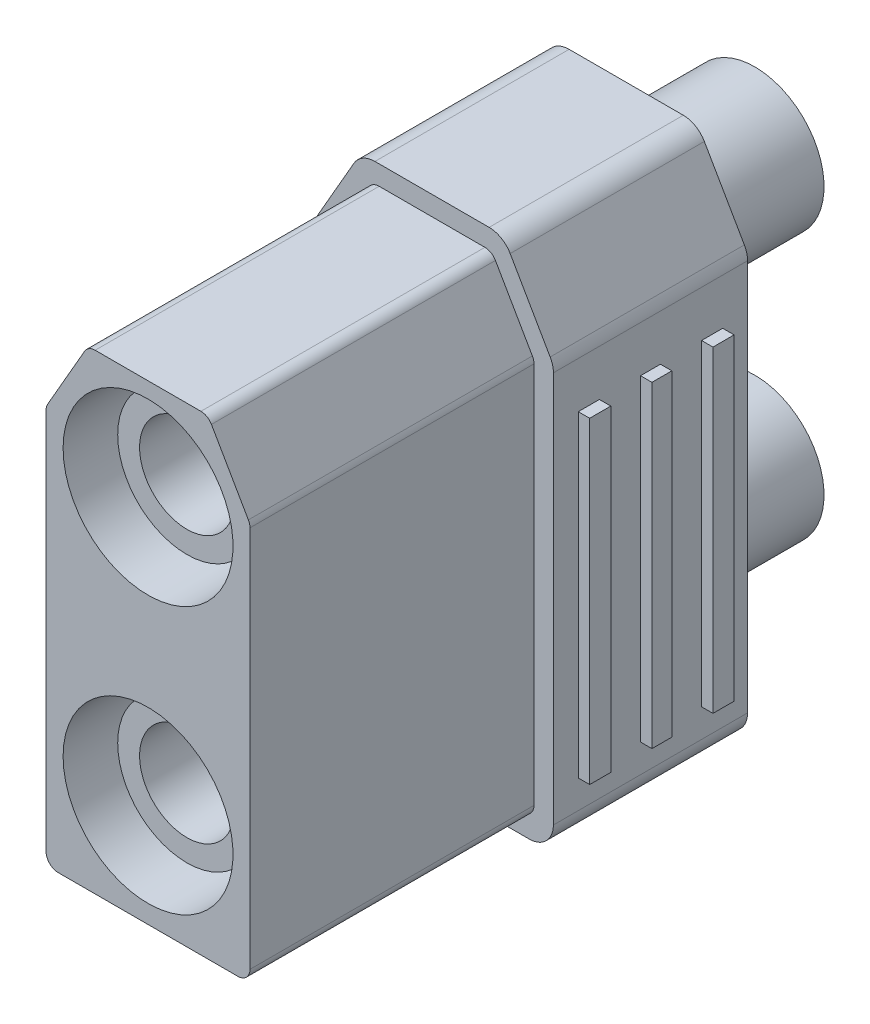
ISO-10303-21;
HEADER;
FILE_DESCRIPTION(('STEP AP214'),'2;1');
FILE_NAME('part.step','',(''),(''),'','','');
FILE_SCHEMA(('AUTOMOTIVE_DESIGN { 1 0 10303 214 1 1 1 1 }'));
ENDSEC;
DATA;
#1=APPLICATION_CONTEXT('core data for automotive mechanical design processes');
#2=APPLICATION_PROTOCOL_DEFINITION('international standard','automotive_design',2000,#1);
#3=PRODUCT_CONTEXT('',#1,'mechanical');
#4=PRODUCT('Part','Part','',(#3));
#5=PRODUCT_RELATED_PRODUCT_CATEGORY('part','',(#4));
#6=PRODUCT_DEFINITION_FORMATION('','',#4);
#7=PRODUCT_DEFINITION_CONTEXT('part definition',#1,'design');
#8=PRODUCT_DEFINITION('design','',#6,#7);
#9=PRODUCT_DEFINITION_SHAPE('','',#8);
#10=(LENGTH_UNIT() NAMED_UNIT(*) SI_UNIT(.MILLI.,.METRE.));
#11=(NAMED_UNIT(*) PLANE_ANGLE_UNIT() SI_UNIT($,.RADIAN.));
#12=(NAMED_UNIT(*) SI_UNIT($,.STERADIAN.) SOLID_ANGLE_UNIT());
#13=UNCERTAINTY_MEASURE_WITH_UNIT(LENGTH_MEASURE(1.E-05),#10,'distance_accuracy_value','');
#14=(GEOMETRIC_REPRESENTATION_CONTEXT(3) GLOBAL_UNCERTAINTY_ASSIGNED_CONTEXT((#13)) GLOBAL_UNIT_ASSIGNED_CONTEXT((#10,
#11,#12)) REPRESENTATION_CONTEXT('',''));
#15=CARTESIAN_POINT('',(0.,0.,0.));
#16=DIRECTION('',(0.,0.,1.));
#17=DIRECTION('',(1.,0.,0.));
#18=AXIS2_PLACEMENT_3D('',#15,#16,#17);
#19=CARTESIAN_POINT('',(0.,-3.65,27.7610173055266));
#20=DIRECTION('',(0.,0.,-1.));
#21=DIRECTION('',(-1.,0.,0.));
#22=AXIS2_PLACEMENT_3D('',#19,#20,#21);
#23=CYLINDRICAL_SURFACE('',#22,2.85);
#24=CARTESIAN_POINT('',(0.,-3.65,18.1));
#25=DIRECTION('',(0.,0.,1.));
#26=DIRECTION('',(1.,0.,0.));
#27=AXIS2_PLACEMENT_3D('',#24,#25,#26);
#28=CIRCLE('',#27,2.85);
#29=CARTESIAN_POINT('',(2.85,-3.65,18.1));
#30=VERTEX_POINT('',#29);
#31=EDGE_CURVE('E78',#30,#30,#28,.F.);
#32=ORIENTED_EDGE('',*,*,#31,.T.);
#33=EDGE_LOOP('',(#32));
#34=FACE_BOUND('',#33,.T.);
#35=CARTESIAN_POINT('',(0.,-3.65,-5.3));
#36=DIRECTION('',(0.,0.,-1.));
#37=DIRECTION('',(-1.,0.,0.));
#38=AXIS2_PLACEMENT_3D('',#35,#36,#37);
#39=CIRCLE('',#38,2.85);
#40=CARTESIAN_POINT('',(-2.85,-3.65,-5.3));
#41=VERTEX_POINT('',#40);
#42=EDGE_CURVE('E85',#41,#41,#39,.T.);
#43=ORIENTED_EDGE('',*,*,#42,.F.);
#44=EDGE_LOOP('',(#43));
#45=FACE_BOUND('',#44,.T.);
#46=ADVANCED_FACE('F74',(#34,#45),#23,.T.);
#47=CARTESIAN_POINT('',(0.,-3.65,27.7610173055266));
#48=DIRECTION('',(0.,0.,-1.));
#49=DIRECTION('',(-1.,0.,0.));
#50=AXIS2_PLACEMENT_3D('',#47,#48,#49);
#51=CYLINDRICAL_SURFACE('',#50,1.95);
#52=CARTESIAN_POINT('',(0.,-3.65,18.1));
#53=DIRECTION('',(0.,0.,1.));
#54=DIRECTION('',(1.,0.,0.));
#55=AXIS2_PLACEMENT_3D('',#52,#53,#54);
#56=CIRCLE('',#55,1.95);
#57=CARTESIAN_POINT('',(1.95,-3.65,18.1));
#58=VERTEX_POINT('',#57);
#59=EDGE_CURVE('E12',#58,#58,#56,.F.);
#60=ORIENTED_EDGE('',*,*,#59,.F.);
#61=EDGE_LOOP('',(#60));
#62=FACE_BOUND('',#61,.T.);
#63=CARTESIAN_POINT('',(0.,-3.65,-5.3));
#64=DIRECTION('',(0.,0.,-1.));
#65=DIRECTION('',(-1.,0.,0.));
#66=AXIS2_PLACEMENT_3D('',#63,#64,#65);
#67=CIRCLE('',#66,1.95);
#68=CARTESIAN_POINT('',(-1.95,-3.65,-5.3));
#69=VERTEX_POINT('',#68);
#70=EDGE_CURVE('E89',#69,#69,#67,.T.);
#71=ORIENTED_EDGE('',*,*,#70,.T.);
#72=EDGE_LOOP('',(#71));
#73=FACE_BOUND('',#72,.T.);
#74=ADVANCED_FACE('F93',(#62,#73),#51,.F.);
#75=CARTESIAN_POINT('',(0.,0.,18.1));
#76=DIRECTION('',(0.,0.,1.));
#77=DIRECTION('',(1.,0.,0.));
#78=AXIS2_PLACEMENT_3D('',#75,#76,#77);
#79=PLANE('',#78);
#80=ORIENTED_EDGE('',*,*,#31,.F.);
#81=EDGE_LOOP('',(#80));
#82=FACE_BOUND('',#81,.T.);
#83=ORIENTED_EDGE('',*,*,#59,.T.);
#84=EDGE_LOOP('',(#83));
#85=FACE_BOUND('',#84,.T.);
#86=ADVANCED_FACE('F76',(#82,#85),#79,.T.);
#87=CARTESIAN_POINT('',(0.,-3.65,-5.3));
#88=DIRECTION('',(0.,0.,-1.));
#89=DIRECTION('',(-1.,0.,0.));
#90=AXIS2_PLACEMENT_3D('',#87,#88,#89);
#91=PLANE('',#90);
#92=ORIENTED_EDGE('',*,*,#42,.T.);
#93=EDGE_LOOP('',(#92));
#94=FACE_BOUND('',#93,.T.);
#95=ORIENTED_EDGE('',*,*,#70,.F.);
#96=EDGE_LOOP('',(#95));
#97=FACE_BOUND('',#96,.T.);
#98=ADVANCED_FACE('F95',(#94,#97),#91,.T.);
#99=CLOSED_SHELL('',(#46,#74,#86,#98));
#100=MANIFOLD_SOLID_BREP('B2',#99);
#101=CARTESIAN_POINT('',(0.,7.35,27.7610173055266));
#102=DIRECTION('',(0.,0.,-1.));
#103=DIRECTION('',(-1.,0.,0.));
#104=AXIS2_PLACEMENT_3D('',#101,#102,#103);
#105=CYLINDRICAL_SURFACE('',#104,2.85);
#106=CARTESIAN_POINT('',(0.,7.35,18.1));
#107=DIRECTION('',(0.,0.,1.));
#108=DIRECTION('',(1.,0.,0.));
#109=AXIS2_PLACEMENT_3D('',#106,#107,#108);
#110=CIRCLE('',#109,2.85);
#111=CARTESIAN_POINT('',(2.85,7.35,18.1));
#112=VERTEX_POINT('',#111);
#113=EDGE_CURVE('E158',#112,#112,#110,.F.);
#114=ORIENTED_EDGE('',*,*,#113,.T.);
#115=EDGE_LOOP('',(#114));
#116=FACE_BOUND('',#115,.T.);
#117=CARTESIAN_POINT('',(0.,7.35,-5.3));
#118=DIRECTION('',(0.,0.,-1.));
#119=DIRECTION('',(-1.,0.,0.));
#120=AXIS2_PLACEMENT_3D('',#117,#118,#119);
#121=CIRCLE('',#120,2.85);
#122=CARTESIAN_POINT('',(-2.85,7.35,-5.3));
#123=VERTEX_POINT('',#122);
#124=EDGE_CURVE('E165',#123,#123,#121,.T.);
#125=ORIENTED_EDGE('',*,*,#124,.F.);
#126=EDGE_LOOP('',(#125));
#127=FACE_BOUND('',#126,.T.);
#128=ADVANCED_FACE('F154',(#116,#127),#105,.T.);
#129=CARTESIAN_POINT('',(0.,7.35,27.7610173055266));
#130=DIRECTION('',(0.,0.,-1.));
#131=DIRECTION('',(-1.,0.,0.));
#132=AXIS2_PLACEMENT_3D('',#129,#130,#131);
#133=CYLINDRICAL_SURFACE('',#132,1.95);
#134=CARTESIAN_POINT('',(0.,7.35,18.1));
#135=DIRECTION('',(0.,0.,1.));
#136=DIRECTION('',(1.,0.,0.));
#137=AXIS2_PLACEMENT_3D('',#134,#135,#136);
#138=CIRCLE('',#137,1.95);
#139=CARTESIAN_POINT('',(1.95,7.35,18.1));
#140=VERTEX_POINT('',#139);
#141=EDGE_CURVE('E73',#140,#140,#138,.F.);
#142=ORIENTED_EDGE('',*,*,#141,.F.);
#143=EDGE_LOOP('',(#142));
#144=FACE_BOUND('',#143,.T.);
#145=CARTESIAN_POINT('',(0.,7.35,-5.3));
#146=DIRECTION('',(0.,0.,-1.));
#147=DIRECTION('',(-1.,0.,0.));
#148=AXIS2_PLACEMENT_3D('',#145,#146,#147);
#149=CIRCLE('',#148,1.95);
#150=CARTESIAN_POINT('',(-1.95,7.35,-5.3));
#151=VERTEX_POINT('',#150);
#152=EDGE_CURVE('E169',#151,#151,#149,.T.);
#153=ORIENTED_EDGE('',*,*,#152,.T.);
#154=EDGE_LOOP('',(#153));
#155=FACE_BOUND('',#154,.T.);
#156=ADVANCED_FACE('F173',(#144,#155),#133,.F.);
#157=CARTESIAN_POINT('',(0.,0.,18.1));
#158=DIRECTION('',(0.,0.,1.));
#159=DIRECTION('',(1.,0.,0.));
#160=AXIS2_PLACEMENT_3D('',#157,#158,#159);
#161=PLANE('',#160);
#162=ORIENTED_EDGE('',*,*,#113,.F.);
#163=EDGE_LOOP('',(#162));
#164=FACE_BOUND('',#163,.T.);
#165=ORIENTED_EDGE('',*,*,#141,.T.);
#166=EDGE_LOOP('',(#165));
#167=FACE_BOUND('',#166,.T.);
#168=ADVANCED_FACE('F156',(#164,#167),#161,.T.);
#169=CARTESIAN_POINT('',(0.,7.35,-5.3));
#170=DIRECTION('',(0.,0.,-1.));
#171=DIRECTION('',(-1.,0.,0.));
#172=AXIS2_PLACEMENT_3D('',#169,#170,#171);
#173=PLANE('',#172);
#174=ORIENTED_EDGE('',*,*,#124,.T.);
#175=EDGE_LOOP('',(#174));
#176=FACE_BOUND('',#175,.T.);
#177=ORIENTED_EDGE('',*,*,#152,.F.);
#178=EDGE_LOOP('',(#177));
#179=FACE_BOUND('',#178,.T.);
#180=ADVANCED_FACE('F175',(#176,#179),#173,.T.);
#181=CLOSED_SHELL('',(#128,#156,#168,#180));
#182=MANIFOLD_SOLID_BREP('B7',#181);
#183=CARTESIAN_POINT('',(5.,8.7,8.));
#184=DIRECTION('',(-1.,0.,0.));
#185=DIRECTION('',(0.,-1.,0.));
#186=AXIS2_PLACEMENT_3D('',#183,#184,#185);
#187=PLANE('',#186);
#188=DIRECTION('',(0.,1.,0.));
#189=VECTOR('',#188,1.);
#190=CARTESIAN_POINT('',(5.,-6.535,6.105));
#191=LINE('',#190,#189);
#192=CARTESIAN_POINT('',(5.,-6.535,6.105));
#193=VERTEX_POINT('',#192);
#194=CARTESIAN_POINT('',(5.,6.535,6.105));
#195=VERTEX_POINT('',#194);
#196=EDGE_CURVE('E720',#193,#195,#191,.T.);
#197=ORIENTED_EDGE('',*,*,#196,.F.);
#198=DIRECTION('',(0.,0.,-1.));
#199=VECTOR('',#198,1.);
#200=CARTESIAN_POINT('',(5.,-6.535,6.975));
#201=LINE('',#200,#199);
#202=CARTESIAN_POINT('',(5.,-6.535,6.975));
#203=VERTEX_POINT('',#202);
#204=EDGE_CURVE('E726',#203,#193,#201,.T.);
#205=ORIENTED_EDGE('',*,*,#204,.F.);
#206=DIRECTION('',(0.,-1.,0.));
#207=VECTOR('',#206,1.);
#208=CARTESIAN_POINT('',(5.,-6.535,6.975));
#209=LINE('',#208,#207);
#210=CARTESIAN_POINT('',(5.,6.535,6.975));
#211=VERTEX_POINT('',#210);
#212=EDGE_CURVE('E743',#211,#203,#209,.T.);
#213=ORIENTED_EDGE('',*,*,#212,.F.);
#214=DIRECTION('',(0.,0.,1.));
#215=VECTOR('',#214,1.);
#216=CARTESIAN_POINT('',(5.,6.535,6.975));
#217=LINE('',#216,#215);
#218=EDGE_CURVE('E739',#195,#211,#217,.T.);
#219=ORIENTED_EDGE('',*,*,#218,.F.);
#220=EDGE_LOOP('',(#197,#205,#213,#219));
#221=FACE_BOUND('',#220,.T.);
#222=DIRECTION('',(0.,1.,0.));
#223=VECTOR('',#222,1.);
#224=CARTESIAN_POINT('',(5.,8.7,8.));
#225=LINE('',#224,#223);
#226=CARTESIAN_POINT('',(5.,-7.7,8.));
#227=VERTEX_POINT('',#226);
#228=CARTESIAN_POINT('',(5.,8.43311186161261,8.));
#229=VERTEX_POINT('',#228);
#230=EDGE_CURVE('E874',#227,#229,#225,.T.);
#231=ORIENTED_EDGE('',*,*,#230,.F.);
#232=DIRECTION('',(0.,0.,-1.));
#233=VECTOR('',#232,1.);
#234=CARTESIAN_POINT('',(5.,-7.7,8.));
#235=LINE('',#234,#233);
#236=CARTESIAN_POINT('',(5.,-7.7,0.));
#237=VERTEX_POINT('',#236);
#238=EDGE_CURVE('E924',#227,#237,#235,.T.);
#239=ORIENTED_EDGE('',*,*,#238,.T.);
#240=DIRECTION('',(0.,1.,0.));
#241=VECTOR('',#240,1.);
#242=CARTESIAN_POINT('',(5.,8.7,0.));
#243=LINE('',#242,#241);
#244=CARTESIAN_POINT('',(5.,8.43311186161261,0.));
#245=VERTEX_POINT('',#244);
#246=EDGE_CURVE('E852',#237,#245,#243,.T.);
#247=ORIENTED_EDGE('',*,*,#246,.T.);
#248=DIRECTION('',(0.,0.,-1.));
#249=VECTOR('',#248,1.);
#250=CARTESIAN_POINT('',(5.,8.43311186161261,8.));
#251=LINE('',#250,#249);
#252=EDGE_CURVE('E899',#245,#229,#251,.F.);
#253=ORIENTED_EDGE('',*,*,#252,.T.);
#254=EDGE_LOOP('',(#231,#239,#247,#253));
#255=FACE_BOUND('',#254,.T.);
#256=DIRECTION('',(0.,1.,0.));
#257=VECTOR('',#256,1.);
#258=CARTESIAN_POINT('',(5.,-6.535,3.59));
#259=LINE('',#258,#257);
#260=CARTESIAN_POINT('',(5.,-6.535,3.59));
#261=VERTEX_POINT('',#260);
#262=CARTESIAN_POINT('',(5.,6.535,3.59));
#263=VERTEX_POINT('',#262);
#264=EDGE_CURVE('E765',#261,#263,#259,.T.);
#265=ORIENTED_EDGE('',*,*,#264,.F.);
#266=DIRECTION('',(0.,0.,-1.));
#267=VECTOR('',#266,1.);
#268=CARTESIAN_POINT('',(5.,-6.535,4.41));
#269=LINE('',#268,#267);
#270=CARTESIAN_POINT('',(5.,-6.535,4.41));
#271=VERTEX_POINT('',#270);
#272=EDGE_CURVE('E771',#271,#261,#269,.T.);
#273=ORIENTED_EDGE('',*,*,#272,.F.);
#274=DIRECTION('',(0.,-1.,0.));
#275=VECTOR('',#274,1.);
#276=CARTESIAN_POINT('',(5.,-6.535,4.41));
#277=LINE('',#276,#275);
#278=CARTESIAN_POINT('',(5.,6.535,4.41));
#279=VERTEX_POINT('',#278);
#280=EDGE_CURVE('E788',#279,#271,#277,.T.);
#281=ORIENTED_EDGE('',*,*,#280,.F.);
#282=DIRECTION('',(0.,0.,1.));
#283=VECTOR('',#282,1.);
#284=CARTESIAN_POINT('',(5.,6.535,4.41));
#285=LINE('',#284,#283);
#286=EDGE_CURVE('E784',#263,#279,#285,.T.);
#287=ORIENTED_EDGE('',*,*,#286,.F.);
#288=EDGE_LOOP('',(#265,#273,#281,#287));
#289=FACE_BOUND('',#288,.T.);
#290=DIRECTION('',(0.,1.,0.));
#291=VECTOR('',#290,1.);
#292=CARTESIAN_POINT('',(5.,-6.535,1.025));
#293=LINE('',#292,#291);
#294=CARTESIAN_POINT('',(5.,-6.535,1.025));
#295=VERTEX_POINT('',#294);
#296=CARTESIAN_POINT('',(5.,6.535,1.025));
#297=VERTEX_POINT('',#296);
#298=EDGE_CURVE('E675',#295,#297,#293,.T.);
#299=ORIENTED_EDGE('',*,*,#298,.F.);
#300=DIRECTION('',(0.,0.,-1.));
#301=VECTOR('',#300,1.);
#302=CARTESIAN_POINT('',(5.,-6.535,1.895));
#303=LINE('',#302,#301);
#304=CARTESIAN_POINT('',(5.,-6.535,1.895));
#305=VERTEX_POINT('',#304);
#306=EDGE_CURVE('E681',#305,#295,#303,.T.);
#307=ORIENTED_EDGE('',*,*,#306,.F.);
#308=DIRECTION('',(0.,-1.,0.));
#309=VECTOR('',#308,1.);
#310=CARTESIAN_POINT('',(5.,-6.535,1.895));
#311=LINE('',#310,#309);
#312=CARTESIAN_POINT('',(5.,6.535,1.895));
#313=VERTEX_POINT('',#312);
#314=EDGE_CURVE('E698',#313,#305,#311,.T.);
#315=ORIENTED_EDGE('',*,*,#314,.F.);
#316=DIRECTION('',(0.,0.,1.));
#317=VECTOR('',#316,1.);
#318=CARTESIAN_POINT('',(5.,6.535,1.895));
#319=LINE('',#318,#317);
#320=EDGE_CURVE('E694',#297,#313,#319,.T.);
#321=ORIENTED_EDGE('',*,*,#320,.F.);
#322=EDGE_LOOP('',(#299,#307,#315,#321));
#323=FACE_BOUND('',#322,.T.);
#324=ADVANCED_FACE('F225',(#221,#255,#289,#323),#187,.F.);
#325=CARTESIAN_POINT('',(0.,0.,8.));
#326=DIRECTION('',(0.,0.,1.));
#327=DIRECTION('',(1.,0.,0.));
#328=AXIS2_PLACEMENT_3D('',#325,#326,#327);
#329=PLANE('',#328);
#330=DIRECTION('',(1.,0.,0.));
#331=VECTOR('',#330,1.);
#332=CARTESIAN_POINT('',(-5.,-8.7,8.));
#333=LINE('',#332,#331);
#334=CARTESIAN_POINT('',(-4.,-8.7,8.));
#335=VERTEX_POINT('',#334);
#336=CARTESIAN_POINT('',(4.,-8.7,8.));
#337=VERTEX_POINT('',#336);
#338=EDGE_CURVE('E895',#335,#337,#333,.T.);
#339=ORIENTED_EDGE('',*,*,#338,.T.);
#340=CARTESIAN_POINT('',(4.,-7.7,8.));
#341=DIRECTION('',(0.,0.,1.));
#342=DIRECTION('',(1.,0.,0.));
#343=AXIS2_PLACEMENT_3D('',#340,#341,#342);
#344=CIRCLE('',#343,1.);
#345=EDGE_CURVE('E968',#337,#227,#344,.T.);
#346=ORIENTED_EDGE('',*,*,#345,.T.);
#347=ORIENTED_EDGE('',*,*,#230,.T.);
#348=CARTESIAN_POINT('',(4.,8.43311186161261,8.));
#349=DIRECTION('',(0.,0.,1.));
#350=DIRECTION('',(1.,0.,0.));
#351=AXIS2_PLACEMENT_3D('',#348,#349,#350);
#352=CIRCLE('',#351,1.);
#353=CARTESIAN_POINT('',(4.86701394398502,8.93139573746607,8.));
#354=VERTEX_POINT('',#353);
#355=EDGE_CURVE('E959',#229,#354,#352,.T.);
#356=ORIENTED_EDGE('',*,*,#355,.T.);
#357=DIRECTION('',(-0.498283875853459,0.867013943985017,0.));
#358=VECTOR('',#357,1.);
#359=CARTESIAN_POINT('',(2.93103448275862,12.3,8.));
#360=LINE('',#359,#358);
#361=CARTESIAN_POINT('',(3.21937708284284,11.7982838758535,8.));
#362=VERTEX_POINT('',#361);
#363=EDGE_CURVE('E878',#354,#362,#360,.T.);
#364=ORIENTED_EDGE('',*,*,#363,.T.);
#365=CARTESIAN_POINT('',(2.35236313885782,11.3,8.));
#366=DIRECTION('',(0.,0.,1.));
#367=DIRECTION('',(1.,0.,0.));
#368=AXIS2_PLACEMENT_3D('',#365,#366,#367);
#369=CIRCLE('',#368,1.);
#370=CARTESIAN_POINT('',(2.35236313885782,12.3,8.));
#371=VERTEX_POINT('',#370);
#372=EDGE_CURVE('E953',#362,#371,#369,.T.);
#373=ORIENTED_EDGE('',*,*,#372,.T.);
#374=DIRECTION('',(-1.,0.,0.));
#375=VECTOR('',#374,1.);
#376=CARTESIAN_POINT('',(-2.93103448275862,12.3,8.));
#377=LINE('',#376,#375);
#378=CARTESIAN_POINT('',(-2.35236313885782,12.3,8.));
#379=VERTEX_POINT('',#378);
#380=EDGE_CURVE('E883',#371,#379,#377,.T.);
#381=ORIENTED_EDGE('',*,*,#380,.T.);
#382=CARTESIAN_POINT('',(-2.35236313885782,11.3,8.));
#383=DIRECTION('',(0.,0.,1.));
#384=DIRECTION('',(1.,0.,0.));
#385=AXIS2_PLACEMENT_3D('',#382,#383,#384);
#386=CIRCLE('',#385,1.);
#387=CARTESIAN_POINT('',(-3.21937708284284,11.7982838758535,8.));
#388=VERTEX_POINT('',#387);
#389=EDGE_CURVE('E956',#379,#388,#386,.T.);
#390=ORIENTED_EDGE('',*,*,#389,.T.);
#391=DIRECTION('',(-0.498283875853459,-0.867013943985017,0.));
#392=VECTOR('',#391,1.);
#393=CARTESIAN_POINT('',(-5.,8.7,8.));
#394=LINE('',#393,#392);
#395=CARTESIAN_POINT('',(-4.86701394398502,8.93139573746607,8.));
#396=VERTEX_POINT('',#395);
#397=EDGE_CURVE('E887',#388,#396,#394,.T.);
#398=ORIENTED_EDGE('',*,*,#397,.T.);
#399=CARTESIAN_POINT('',(-4.,8.43311186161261,8.));
#400=DIRECTION('',(0.,0.,1.));
#401=DIRECTION('',(1.,0.,0.));
#402=AXIS2_PLACEMENT_3D('',#399,#400,#401);
#403=CIRCLE('',#402,1.);
#404=CARTESIAN_POINT('',(-5.,8.43311186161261,8.));
#405=VERTEX_POINT('',#404);
#406=EDGE_CURVE('E962',#396,#405,#403,.T.);
#407=ORIENTED_EDGE('',*,*,#406,.T.);
#408=DIRECTION('',(0.,-1.,0.));
#409=VECTOR('',#408,1.);
#410=CARTESIAN_POINT('',(-5.,8.7,8.));
#411=LINE('',#410,#409);
#412=CARTESIAN_POINT('',(-5.,-7.7,8.));
#413=VERTEX_POINT('',#412);
#414=EDGE_CURVE('E891',#405,#413,#411,.T.);
#415=ORIENTED_EDGE('',*,*,#414,.T.);
#416=CARTESIAN_POINT('',(-4.,-7.7,8.));
#417=DIRECTION('',(0.,0.,1.));
#418=DIRECTION('',(1.,0.,0.));
#419=AXIS2_PLACEMENT_3D('',#416,#417,#418);
#420=CIRCLE('',#419,1.);
#421=EDGE_CURVE('E965',#413,#335,#420,.T.);
#422=ORIENTED_EDGE('',*,*,#421,.T.);
#423=EDGE_LOOP('',(#339,#346,#347,#356,#364,#373,#381,#390,#398,#407,#415,#422));
#424=FACE_BOUND('',#423,.T.);
#425=DIRECTION('',(0.,-1.,0.));
#426=VECTOR('',#425,1.);
#427=CARTESIAN_POINT('',(-4.2,8.48648948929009,8.));
#428=LINE('',#427,#426);
#429=CARTESIAN_POINT('',(-4.2,8.35304542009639,8.));
#430=VERTEX_POINT('',#429);
#431=CARTESIAN_POINT('',(-4.2,-7.4,8.));
#432=VERTEX_POINT('',#431);
#433=EDGE_CURVE('E855',#430,#432,#428,.T.);
#434=ORIENTED_EDGE('',*,*,#433,.F.);
#435=CARTESIAN_POINT('',(-3.7,8.35304542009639,8.));
#436=DIRECTION('',(0.,0.,1.));
#437=DIRECTION('',(1.,0.,0.));
#438=AXIS2_PLACEMENT_3D('',#435,#436,#437);
#439=CIRCLE('',#438,0.5);
#440=CARTESIAN_POINT('',(-4.13350697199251,8.60218735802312,8.));
#441=VERTEX_POINT('',#440);
#442=EDGE_CURVE('E234',#430,#441,#439,.F.);
#443=ORIENTED_EDGE('',*,*,#442,.T.);
#444=DIRECTION('',(-0.498283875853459,-0.867013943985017,0.));
#445=VECTOR('',#444,1.);
#446=CARTESIAN_POINT('',(-2.46809740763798,11.5,8.));
#447=LINE('',#446,#445);
#448=CARTESIAN_POINT('',(-2.61226870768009,11.2491419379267,8.));
#449=VERTEX_POINT('',#448);
#450=EDGE_CURVE('E823',#449,#441,#447,.T.);
#451=ORIENTED_EDGE('',*,*,#450,.F.);
#452=CARTESIAN_POINT('',(-2.17876173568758,11.,8.));
#453=DIRECTION('',(0.,0.,1.));
#454=DIRECTION('',(1.,0.,0.));
#455=AXIS2_PLACEMENT_3D('',#452,#453,#454);
#456=CIRCLE('',#455,0.5);
#457=CARTESIAN_POINT('',(-2.17876173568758,11.5,8.));
#458=VERTEX_POINT('',#457);
#459=EDGE_CURVE('E152',#449,#458,#456,.F.);
#460=ORIENTED_EDGE('',*,*,#459,.T.);
#461=DIRECTION('',(-1.,0.,0.));
#462=VECTOR('',#461,1.);
#463=CARTESIAN_POINT('',(2.46809740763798,11.5,8.));
#464=LINE('',#463,#462);
#465=CARTESIAN_POINT('',(2.17876173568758,11.5,8.));
#466=VERTEX_POINT('',#465);
#467=EDGE_CURVE('E832',#466,#458,#464,.T.);
#468=ORIENTED_EDGE('',*,*,#467,.F.);
#469=CARTESIAN_POINT('',(2.17876173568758,11.,8.));
#470=DIRECTION('',(0.,0.,1.));
#471=DIRECTION('',(1.,0.,0.));
#472=AXIS2_PLACEMENT_3D('',#469,#470,#471);
#473=CIRCLE('',#472,0.5);
#474=CARTESIAN_POINT('',(2.61226870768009,11.2491419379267,8.));
#475=VERTEX_POINT('',#474);
#476=EDGE_CURVE('E1067',#466,#475,#473,.F.);
#477=ORIENTED_EDGE('',*,*,#476,.T.);
#478=DIRECTION('',(-0.498283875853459,0.867013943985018,0.));
#479=VECTOR('',#478,1.);
#480=CARTESIAN_POINT('',(4.2,8.48648948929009,8.));
#481=LINE('',#480,#479);
#482=CARTESIAN_POINT('',(4.13350697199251,8.60218735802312,8.));
#483=VERTEX_POINT('',#482);
#484=EDGE_CURVE('E867',#483,#475,#481,.T.);
#485=ORIENTED_EDGE('',*,*,#484,.F.);
#486=CARTESIAN_POINT('',(3.7,8.35304542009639,8.));
#487=DIRECTION('',(0.,0.,1.));
#488=DIRECTION('',(1.,0.,0.));
#489=AXIS2_PLACEMENT_3D('',#486,#487,#488);
#490=CIRCLE('',#489,0.5);
#491=CARTESIAN_POINT('',(4.2,8.35304542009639,8.));
#492=VERTEX_POINT('',#491);
#493=EDGE_CURVE('E1064',#483,#492,#490,.F.);
#494=ORIENTED_EDGE('',*,*,#493,.T.);
#495=DIRECTION('',(0.,1.,0.));
#496=VECTOR('',#495,1.);
#497=CARTESIAN_POINT('',(4.2,-7.9,8.));
#498=LINE('',#497,#496);
#499=CARTESIAN_POINT('',(4.2,-7.4,8.));
#500=VERTEX_POINT('',#499);
#501=EDGE_CURVE('E863',#500,#492,#498,.T.);
#502=ORIENTED_EDGE('',*,*,#501,.F.);
#503=CARTESIAN_POINT('',(3.7,-7.4,8.));
#504=DIRECTION('',(0.,0.,1.));
#505=DIRECTION('',(1.,0.,0.));
#506=AXIS2_PLACEMENT_3D('',#503,#504,#505);
#507=CIRCLE('',#506,0.5);
#508=CARTESIAN_POINT('',(3.7,-7.9,8.));
#509=VERTEX_POINT('',#508);
#510=EDGE_CURVE('E1061',#500,#509,#507,.F.);
#511=ORIENTED_EDGE('',*,*,#510,.T.);
#512=DIRECTION('',(1.,0.,0.));
#513=VECTOR('',#512,1.);
#514=CARTESIAN_POINT('',(-4.2,-7.9,8.));
#515=LINE('',#514,#513);
#516=CARTESIAN_POINT('',(-3.7,-7.9,8.));
#517=VERTEX_POINT('',#516);
#518=EDGE_CURVE('E859',#517,#509,#515,.T.);
#519=ORIENTED_EDGE('',*,*,#518,.F.);
#520=CARTESIAN_POINT('',(-3.7,-7.4,8.));
#521=DIRECTION('',(0.,0.,1.));
#522=DIRECTION('',(1.,0.,0.));
#523=AXIS2_PLACEMENT_3D('',#520,#521,#522);
#524=CIRCLE('',#523,0.5);
#525=EDGE_CURVE('E1058',#517,#432,#524,.F.);
#526=ORIENTED_EDGE('',*,*,#525,.T.);
#527=EDGE_LOOP('',(#434,#443,#451,#460,#468,#477,#485,#494,#502,#511,#519,#526));
#528=FACE_BOUND('',#527,.T.);
#529=ADVANCED_FACE('F1072',(#424,#528),#329,.T.);
#530=CARTESIAN_POINT('',(2.93103448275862,12.3,8.));
#531=DIRECTION('',(-0.867013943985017,-0.498283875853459,0.));
#532=DIRECTION('',(0.498283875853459,-0.867013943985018,0.));
#533=AXIS2_PLACEMENT_3D('',#530,#531,#532);
#534=PLANE('',#533);
#535=ORIENTED_EDGE('',*,*,#363,.F.);
#536=DIRECTION('',(0.,0.,-1.));
#537=VECTOR('',#536,1.);
#538=CARTESIAN_POINT('',(4.86701394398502,8.93139573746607,8.));
#539=LINE('',#538,#537);
#540=CARTESIAN_POINT('',(4.86701394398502,8.93139573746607,0.));
#541=VERTEX_POINT('',#540);
#542=EDGE_CURVE('E988',#354,#541,#539,.T.);
#543=ORIENTED_EDGE('',*,*,#542,.T.);
#544=DIRECTION('',(-0.498283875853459,0.867013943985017,0.));
#545=VECTOR('',#544,1.);
#546=CARTESIAN_POINT('',(2.93103448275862,12.3,0.));
#547=LINE('',#546,#545);
#548=CARTESIAN_POINT('',(3.21937708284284,11.7982838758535,0.));
#549=VERTEX_POINT('',#548);
#550=EDGE_CURVE('E903',#541,#549,#547,.T.);
#551=ORIENTED_EDGE('',*,*,#550,.T.);
#552=DIRECTION('',(0.,0.,-1.));
#553=VECTOR('',#552,1.);
#554=CARTESIAN_POINT('',(3.21937708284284,11.7982838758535,8.));
#555=LINE('',#554,#553);
#556=EDGE_CURVE('E985',#549,#362,#555,.F.);
#557=ORIENTED_EDGE('',*,*,#556,.T.);
#558=EDGE_LOOP('',(#535,#543,#551,#557));
#559=FACE_BOUND('',#558,.T.);
#560=ADVANCED_FACE('F1137',(#559),#534,.F.);
#561=CARTESIAN_POINT('',(-2.93103448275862,12.3,8.));
#562=DIRECTION('',(0.,-1.,0.));
#563=DIRECTION('',(0.,0.,-1.));
#564=AXIS2_PLACEMENT_3D('',#561,#562,#563);
#565=PLANE('',#564);
#566=DIRECTION('',(-1.,0.,0.));
#567=VECTOR('',#566,1.);
#568=CARTESIAN_POINT('',(-2.93103448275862,12.3,0.));
#569=LINE('',#568,#567);
#570=CARTESIAN_POINT('',(2.35236313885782,12.3,0.));
#571=VERTEX_POINT('',#570);
#572=CARTESIAN_POINT('',(-2.35236313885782,12.3,0.));
#573=VERTEX_POINT('',#572);
#574=EDGE_CURVE('E907',#571,#573,#569,.T.);
#575=ORIENTED_EDGE('',*,*,#574,.T.);
#576=DIRECTION('',(0.,0.,-1.));
#577=VECTOR('',#576,1.);
#578=CARTESIAN_POINT('',(-2.35236313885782,12.3,8.));
#579=LINE('',#578,#577);
#580=EDGE_CURVE('E996',#573,#379,#579,.F.);
#581=ORIENTED_EDGE('',*,*,#580,.T.);
#582=ORIENTED_EDGE('',*,*,#380,.F.);
#583=DIRECTION('',(0.,0.,-1.));
#584=VECTOR('',#583,1.);
#585=CARTESIAN_POINT('',(2.35236313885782,12.3,8.));
#586=LINE('',#585,#584);
#587=EDGE_CURVE('E992',#371,#571,#586,.T.);
#588=ORIENTED_EDGE('',*,*,#587,.T.);
#589=EDGE_LOOP('',(#575,#581,#582,#588));
#590=FACE_BOUND('',#589,.T.);
#591=ADVANCED_FACE('F1659',(#590),#565,.F.);
#592=CARTESIAN_POINT('',(-5.,8.7,8.));
#593=DIRECTION('',(0.867013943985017,-0.498283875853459,0.));
#594=DIRECTION('',(0.498283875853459,0.867013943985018,0.));
#595=AXIS2_PLACEMENT_3D('',#592,#593,#594);
#596=PLANE('',#595);
#597=DIRECTION('',(-0.498283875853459,-0.867013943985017,0.));
#598=VECTOR('',#597,1.);
#599=CARTESIAN_POINT('',(-5.,8.7,0.));
#600=LINE('',#599,#598);
#601=CARTESIAN_POINT('',(-3.21937708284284,11.7982838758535,0.));
#602=VERTEX_POINT('',#601);
#603=CARTESIAN_POINT('',(-4.86701394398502,8.93139573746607,0.));
#604=VERTEX_POINT('',#603);
#605=EDGE_CURVE('E911',#602,#604,#600,.T.);
#606=ORIENTED_EDGE('',*,*,#605,.T.);
#607=DIRECTION('',(0.,0.,-1.));
#608=VECTOR('',#607,1.);
#609=CARTESIAN_POINT('',(-4.86701394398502,8.93139573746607,8.));
#610=LINE('',#609,#608);
#611=EDGE_CURVE('E982',#604,#396,#610,.F.);
#612=ORIENTED_EDGE('',*,*,#611,.T.);
#613=ORIENTED_EDGE('',*,*,#397,.F.);
#614=DIRECTION('',(0.,0.,-1.));
#615=VECTOR('',#614,1.);
#616=CARTESIAN_POINT('',(-3.21937708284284,11.7982838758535,8.));
#617=LINE('',#616,#615);
#618=EDGE_CURVE('E978',#388,#602,#617,.T.);
#619=ORIENTED_EDGE('',*,*,#618,.T.);
#620=EDGE_LOOP('',(#606,#612,#613,#619));
#621=FACE_BOUND('',#620,.T.);
#622=ADVANCED_FACE('F1650',(#621),#596,.F.);
#623=CARTESIAN_POINT('',(-5.,8.7,8.));
#624=DIRECTION('',(1.,0.,0.));
#625=DIRECTION('',(0.,1.,0.));
#626=AXIS2_PLACEMENT_3D('',#623,#624,#625);
#627=PLANE('',#626);
#628=DIRECTION('',(0.,0.,-1.));
#629=VECTOR('',#628,1.);
#630=CARTESIAN_POINT('',(-5.,-6.535,1.895));
#631=LINE('',#630,#629);
#632=CARTESIAN_POINT('',(-5.,-6.535,1.895));
#633=VERTEX_POINT('',#632);
#634=CARTESIAN_POINT('',(-5.,-6.535,1.025));
#635=VERTEX_POINT('',#634);
#636=EDGE_CURVE('E568',#633,#635,#631,.T.);
#637=ORIENTED_EDGE('',*,*,#636,.T.);
#638=DIRECTION('',(0.,1.,0.));
#639=VECTOR('',#638,1.);
#640=CARTESIAN_POINT('',(-5.,-6.535,1.025));
#641=LINE('',#640,#639);
#642=CARTESIAN_POINT('',(-5.,6.535,1.025));
#643=VERTEX_POINT('',#642);
#644=EDGE_CURVE('E536',#635,#643,#641,.T.);
#645=ORIENTED_EDGE('',*,*,#644,.T.);
#646=DIRECTION('',(0.,0.,1.));
#647=VECTOR('',#646,1.);
#648=CARTESIAN_POINT('',(-5.,6.535,1.895));
#649=LINE('',#648,#647);
#650=CARTESIAN_POINT('',(-5.,6.535,1.895));
#651=VERTEX_POINT('',#650);
#652=EDGE_CURVE('E554',#643,#651,#649,.T.);
#653=ORIENTED_EDGE('',*,*,#652,.T.);
#654=DIRECTION('',(0.,-1.,0.));
#655=VECTOR('',#654,1.);
#656=CARTESIAN_POINT('',(-5.,-6.535,1.895));
#657=LINE('',#656,#655);
#658=EDGE_CURVE('E571',#651,#633,#657,.T.);
#659=ORIENTED_EDGE('',*,*,#658,.T.);
#660=EDGE_LOOP('',(#637,#645,#653,#659));
#661=FACE_BOUND('',#660,.T.);
#662=DIRECTION('',(0.,0.,-1.));
#663=VECTOR('',#662,1.);
#664=CARTESIAN_POINT('',(-5.,-6.535,6.975));
#665=LINE('',#664,#663);
#666=CARTESIAN_POINT('',(-5.,-6.535,6.975));
#667=VERTEX_POINT('',#666);
#668=CARTESIAN_POINT('',(-5.,-6.535,6.105));
#669=VERTEX_POINT('',#668);
#670=EDGE_CURVE('E607',#667,#669,#665,.T.);
#671=ORIENTED_EDGE('',*,*,#670,.T.);
#672=DIRECTION('',(0.,1.,0.));
#673=VECTOR('',#672,1.);
#674=CARTESIAN_POINT('',(-5.,-6.535,6.105));
#675=LINE('',#674,#673);
#676=CARTESIAN_POINT('',(-5.,6.535,6.105));
#677=VERTEX_POINT('',#676);
#678=EDGE_CURVE('E542',#669,#677,#675,.T.);
#679=ORIENTED_EDGE('',*,*,#678,.T.);
#680=DIRECTION('',(0.,0.,1.));
#681=VECTOR('',#680,1.);
#682=CARTESIAN_POINT('',(-5.,6.535,6.975));
#683=LINE('',#682,#681);
#684=CARTESIAN_POINT('',(-5.,6.535,6.975));
#685=VERTEX_POINT('',#684);
#686=EDGE_CURVE('E591',#677,#685,#683,.T.);
#687=ORIENTED_EDGE('',*,*,#686,.T.);
#688=DIRECTION('',(0.,-1.,0.));
#689=VECTOR('',#688,1.);
#690=CARTESIAN_POINT('',(-5.,-6.535,6.975));
#691=LINE('',#690,#689);
#692=EDGE_CURVE('E611',#685,#667,#691,.T.);
#693=ORIENTED_EDGE('',*,*,#692,.T.);
#694=EDGE_LOOP('',(#671,#679,#687,#693));
#695=FACE_BOUND('',#694,.T.);
#696=DIRECTION('',(0.,0.,-1.));
#697=VECTOR('',#696,1.);
#698=CARTESIAN_POINT('',(-5.,-6.535,4.41));
#699=LINE('',#698,#697);
#700=CARTESIAN_POINT('',(-5.,-6.535,4.41));
#701=VERTEX_POINT('',#700);
#702=CARTESIAN_POINT('',(-5.,-6.535,3.59));
#703=VERTEX_POINT('',#702);
#704=EDGE_CURVE('E652',#701,#703,#699,.T.);
#705=ORIENTED_EDGE('',*,*,#704,.T.);
#706=DIRECTION('',(0.,1.,0.));
#707=VECTOR('',#706,1.);
#708=CARTESIAN_POINT('',(-5.,-6.535,3.59));
#709=LINE('',#708,#707);
#710=CARTESIAN_POINT('',(-5.,6.535,3.59));
#711=VERTEX_POINT('',#710);
#712=EDGE_CURVE('E630',#703,#711,#709,.T.);
#713=ORIENTED_EDGE('',*,*,#712,.T.);
#714=DIRECTION('',(0.,0.,1.));
#715=VECTOR('',#714,1.);
#716=CARTESIAN_POINT('',(-5.,6.535,4.41));
#717=LINE('',#716,#715);
#718=CARTESIAN_POINT('',(-5.,6.535,4.41));
#719=VERTEX_POINT('',#718);
#720=EDGE_CURVE('E636',#711,#719,#717,.T.);
#721=ORIENTED_EDGE('',*,*,#720,.T.);
#722=DIRECTION('',(0.,-1.,0.));
#723=VECTOR('',#722,1.);
#724=CARTESIAN_POINT('',(-5.,-6.535,4.41));
#725=LINE('',#724,#723);
#726=EDGE_CURVE('E656',#719,#701,#725,.T.);
#727=ORIENTED_EDGE('',*,*,#726,.T.);
#728=EDGE_LOOP('',(#705,#713,#721,#727));
#729=FACE_BOUND('',#728,.T.);
#730=DIRECTION('',(0.,-1.,0.));
#731=VECTOR('',#730,1.);
#732=CARTESIAN_POINT('',(-5.,8.7,0.));
#733=LINE('',#732,#731);
#734=CARTESIAN_POINT('',(-5.,8.43311186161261,0.));
#735=VERTEX_POINT('',#734);
#736=CARTESIAN_POINT('',(-5.,-7.7,0.));
#737=VERTEX_POINT('',#736);
#738=EDGE_CURVE('E915',#735,#737,#733,.T.);
#739=ORIENTED_EDGE('',*,*,#738,.T.);
#740=DIRECTION('',(0.,0.,-1.));
#741=VECTOR('',#740,1.);
#742=CARTESIAN_POINT('',(-5.,-7.7,8.));
#743=LINE('',#742,#741);
#744=EDGE_CURVE('E975',#737,#413,#743,.F.);
#745=ORIENTED_EDGE('',*,*,#744,.T.);
#746=ORIENTED_EDGE('',*,*,#414,.F.);
#747=DIRECTION('',(0.,0.,-1.));
#748=VECTOR('',#747,1.);
#749=CARTESIAN_POINT('',(-5.,8.43311186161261,8.));
#750=LINE('',#749,#748);
#751=EDGE_CURVE('E971',#405,#735,#750,.T.);
#752=ORIENTED_EDGE('',*,*,#751,.T.);
#753=EDGE_LOOP('',(#739,#745,#746,#752));
#754=FACE_BOUND('',#753,.T.);
#755=ADVANCED_FACE('F1641',(#661,#695,#729,#754),#627,.F.);
#756=CARTESIAN_POINT('',(-5.,-8.7,8.));
#757=DIRECTION('',(0.,1.,0.));
#758=DIRECTION('',(0.,0.,1.));
#759=AXIS2_PLACEMENT_3D('',#756,#757,#758);
#760=PLANE('',#759);
#761=DIRECTION('',(1.,0.,0.));
#762=VECTOR('',#761,1.);
#763=CARTESIAN_POINT('',(-5.,-8.7,0.));
#764=LINE('',#763,#762);
#765=CARTESIAN_POINT('',(-4.,-8.7,0.));
#766=VERTEX_POINT('',#765);
#767=CARTESIAN_POINT('',(4.,-8.7,0.));
#768=VERTEX_POINT('',#767);
#769=EDGE_CURVE('E879',#766,#768,#764,.T.);
#770=ORIENTED_EDGE('',*,*,#769,.T.);
#771=DIRECTION('',(0.,0.,-1.));
#772=VECTOR('',#771,1.);
#773=CARTESIAN_POINT('',(4.,-8.7,8.));
#774=LINE('',#773,#772);
#775=EDGE_CURVE('E950',#768,#337,#774,.F.);
#776=ORIENTED_EDGE('',*,*,#775,.T.);
#777=ORIENTED_EDGE('',*,*,#338,.F.);
#778=DIRECTION('',(0.,0.,-1.));
#779=VECTOR('',#778,1.);
#780=CARTESIAN_POINT('',(-4.,-8.7,8.));
#781=LINE('',#780,#779);
#782=EDGE_CURVE('E946',#335,#766,#781,.T.);
#783=ORIENTED_EDGE('',*,*,#782,.T.);
#784=EDGE_LOOP('',(#770,#776,#777,#783));
#785=FACE_BOUND('',#784,.T.);
#786=ADVANCED_FACE('F1632',(#785),#760,.F.);
#787=CARTESIAN_POINT('',(0.,0.,0.));
#788=DIRECTION('',(0.,0.,1.));
#789=DIRECTION('',(1.,0.,0.));
#790=AXIS2_PLACEMENT_3D('',#787,#788,#789);
#791=PLANE('',#790);
#792=CARTESIAN_POINT('',(0.,7.35,0.));
#793=DIRECTION('',(0.,0.,-1.));
#794=DIRECTION('',(-1.,0.,0.));
#795=AXIS2_PLACEMENT_3D('',#792,#793,#794);
#796=CIRCLE('',#795,3.5);
#797=CARTESIAN_POINT('',(-3.5,7.35,0.));
#798=VERTEX_POINT('',#797);
#799=EDGE_CURVE('E810',#798,#798,#796,.T.);
#800=ORIENTED_EDGE('',*,*,#799,.F.);
#801=EDGE_LOOP('',(#800));
#802=FACE_BOUND('',#801,.T.);
#803=CARTESIAN_POINT('',(0.,-3.65,0.));
#804=DIRECTION('',(0.,0.,-1.));
#805=DIRECTION('',(-1.,0.,0.));
#806=AXIS2_PLACEMENT_3D('',#803,#804,#805);
#807=CIRCLE('',#806,3.5);
#808=CARTESIAN_POINT('',(-3.5,-3.65,0.));
#809=VERTEX_POINT('',#808);
#810=EDGE_CURVE('E815',#809,#809,#807,.T.);
#811=ORIENTED_EDGE('',*,*,#810,.F.);
#812=EDGE_LOOP('',(#811));
#813=FACE_BOUND('',#812,.T.);
#814=ORIENTED_EDGE('',*,*,#246,.F.);
#815=CARTESIAN_POINT('',(4.,-7.7,0.));
#816=DIRECTION('',(0.,0.,1.));
#817=DIRECTION('',(1.,0.,0.));
#818=AXIS2_PLACEMENT_3D('',#815,#816,#817);
#819=CIRCLE('',#818,1.);
#820=EDGE_CURVE('E943',#237,#768,#819,.F.);
#821=ORIENTED_EDGE('',*,*,#820,.T.);
#822=ORIENTED_EDGE('',*,*,#769,.F.);
#823=CARTESIAN_POINT('',(-4.,-7.7,0.));
#824=DIRECTION('',(0.,0.,1.));
#825=DIRECTION('',(1.,0.,0.));
#826=AXIS2_PLACEMENT_3D('',#823,#824,#825);
#827=CIRCLE('',#826,1.);
#828=EDGE_CURVE('E940',#766,#737,#827,.F.);
#829=ORIENTED_EDGE('',*,*,#828,.T.);
#830=ORIENTED_EDGE('',*,*,#738,.F.);
#831=CARTESIAN_POINT('',(-4.,8.43311186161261,0.));
#832=DIRECTION('',(0.,0.,1.));
#833=DIRECTION('',(1.,0.,0.));
#834=AXIS2_PLACEMENT_3D('',#831,#832,#833);
#835=CIRCLE('',#834,1.);
#836=EDGE_CURVE('E937',#735,#604,#835,.F.);
#837=ORIENTED_EDGE('',*,*,#836,.T.);
#838=ORIENTED_EDGE('',*,*,#605,.F.);
#839=CARTESIAN_POINT('',(-2.35236313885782,11.3,0.));
#840=DIRECTION('',(0.,0.,1.));
#841=DIRECTION('',(1.,0.,0.));
#842=AXIS2_PLACEMENT_3D('',#839,#840,#841);
#843=CIRCLE('',#842,1.);
#844=EDGE_CURVE('E931',#602,#573,#843,.F.);
#845=ORIENTED_EDGE('',*,*,#844,.T.);
#846=ORIENTED_EDGE('',*,*,#574,.F.);
#847=CARTESIAN_POINT('',(2.35236313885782,11.3,0.));
#848=DIRECTION('',(0.,0.,1.));
#849=DIRECTION('',(1.,0.,0.));
#850=AXIS2_PLACEMENT_3D('',#847,#848,#849);
#851=CIRCLE('',#850,1.);
#852=EDGE_CURVE('E928',#571,#549,#851,.F.);
#853=ORIENTED_EDGE('',*,*,#852,.T.);
#854=ORIENTED_EDGE('',*,*,#550,.F.);
#855=CARTESIAN_POINT('',(4.,8.43311186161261,0.));
#856=DIRECTION('',(0.,0.,1.));
#857=DIRECTION('',(1.,0.,0.));
#858=AXIS2_PLACEMENT_3D('',#855,#856,#857);
#859=CIRCLE('',#858,1.);
#860=EDGE_CURVE('E934',#541,#245,#859,.F.);
#861=ORIENTED_EDGE('',*,*,#860,.T.);
#862=EDGE_LOOP('',(#814,#821,#822,#829,#830,#837,#838,#845,#846,#853,#854,#861));
#863=FACE_BOUND('',#862,.T.);
#864=ADVANCED_FACE('F1617',(#802,#813,#863),#791,.F.);
#865=CARTESIAN_POINT('',(-2.46809740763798,11.5,19.7));
#866=DIRECTION('',(0.867013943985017,-0.498283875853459,0.));
#867=DIRECTION('',(0.498283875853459,0.867013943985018,0.));
#868=AXIS2_PLACEMENT_3D('',#865,#866,#867);
#869=PLANE('',#868);
#870=ORIENTED_EDGE('',*,*,#450,.T.);
#871=DIRECTION('',(0.,0.,-1.));
#872=VECTOR('',#871,1.);
#873=CARTESIAN_POINT('',(-4.13350697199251,8.60218735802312,19.7));
#874=LINE('',#873,#872);
#875=CARTESIAN_POINT('',(-4.13350697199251,8.60218735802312,19.7));
#876=VERTEX_POINT('',#875);
#877=EDGE_CURVE('E1055',#441,#876,#874,.F.);
#878=ORIENTED_EDGE('',*,*,#877,.T.);
#879=DIRECTION('',(-0.498283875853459,-0.867013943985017,0.));
#880=VECTOR('',#879,1.);
#881=CARTESIAN_POINT('',(-2.46809740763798,11.5,19.7));
#882=LINE('',#881,#880);
#883=CARTESIAN_POINT('',(-2.61226870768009,11.2491419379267,19.7));
#884=VERTEX_POINT('',#883);
#885=EDGE_CURVE('E827',#884,#876,#882,.T.);
#886=ORIENTED_EDGE('',*,*,#885,.F.);
#887=DIRECTION('',(0.,0.,-1.));
#888=VECTOR('',#887,1.);
#889=CARTESIAN_POINT('',(-2.61226870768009,11.2491419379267,19.7));
#890=LINE('',#889,#888);
#891=EDGE_CURVE('E1052',#884,#449,#890,.T.);
#892=ORIENTED_EDGE('',*,*,#891,.T.);
#893=EDGE_LOOP('',(#870,#878,#886,#892));
#894=FACE_BOUND('',#893,.T.);
#895=ADVANCED_FACE('F1091',(#894),#869,.F.);
#896=CARTESIAN_POINT('',(-4.2,8.48648948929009,19.7));
#897=DIRECTION('',(1.,0.,0.));
#898=DIRECTION('',(0.,1.,0.));
#899=AXIS2_PLACEMENT_3D('',#896,#897,#898);
#900=PLANE('',#899);
#901=ORIENTED_EDGE('',*,*,#433,.T.);
#902=DIRECTION('',(0.,0.,-1.));
#903=VECTOR('',#902,1.);
#904=CARTESIAN_POINT('',(-4.2,-7.4,19.7));
#905=LINE('',#904,#903);
#906=CARTESIAN_POINT('',(-4.2,-7.4,19.7));
#907=VERTEX_POINT('',#906);
#908=EDGE_CURVE('E1010',#432,#907,#905,.F.);
#909=ORIENTED_EDGE('',*,*,#908,.T.);
#910=DIRECTION('',(0.,-1.,0.));
#911=VECTOR('',#910,1.);
#912=CARTESIAN_POINT('',(-4.2,8.48648948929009,19.7));
#913=LINE('',#912,#911);
#914=CARTESIAN_POINT('',(-4.2,8.35304542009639,19.7));
#915=VERTEX_POINT('',#914);
#916=EDGE_CURVE('E831',#915,#907,#913,.T.);
#917=ORIENTED_EDGE('',*,*,#916,.F.);
#918=DIRECTION('',(0.,0.,-1.));
#919=VECTOR('',#918,1.);
#920=CARTESIAN_POINT('',(-4.2,8.35304542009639,19.7));
#921=LINE('',#920,#919);
#922=EDGE_CURVE('E1006',#915,#430,#921,.T.);
#923=ORIENTED_EDGE('',*,*,#922,.T.);
#924=EDGE_LOOP('',(#901,#909,#917,#923));
#925=FACE_BOUND('',#924,.T.);
#926=ADVANCED_FACE('F1099',(#925),#900,.F.);
#927=CARTESIAN_POINT('',(-4.2,-7.9,19.7));
#928=DIRECTION('',(0.,1.,0.));
#929=DIRECTION('',(0.,0.,1.));
#930=AXIS2_PLACEMENT_3D('',#927,#928,#929);
#931=PLANE('',#930);
#932=DIRECTION('',(1.,0.,0.));
#933=VECTOR('',#932,1.);
#934=CARTESIAN_POINT('',(-4.2,-7.9,19.7));
#935=LINE('',#934,#933);
#936=CARTESIAN_POINT('',(-3.7,-7.9,19.7));
#937=VERTEX_POINT('',#936);
#938=CARTESIAN_POINT('',(3.7,-7.9,19.7));
#939=VERTEX_POINT('',#938);
#940=EDGE_CURVE('E836',#937,#939,#935,.T.);
#941=ORIENTED_EDGE('',*,*,#940,.F.);
#942=DIRECTION('',(0.,0.,-1.));
#943=VECTOR('',#942,1.);
#944=CARTESIAN_POINT('',(-3.7,-7.9,19.7));
#945=LINE('',#944,#943);
#946=EDGE_CURVE('E1002',#937,#517,#945,.T.);
#947=ORIENTED_EDGE('',*,*,#946,.T.);
#948=ORIENTED_EDGE('',*,*,#518,.T.);
#949=DIRECTION('',(0.,0.,-1.));
#950=VECTOR('',#949,1.);
#951=CARTESIAN_POINT('',(3.7,-7.9,19.7));
#952=LINE('',#951,#950);
#953=EDGE_CURVE('E999',#509,#939,#952,.F.);
#954=ORIENTED_EDGE('',*,*,#953,.T.);
#955=EDGE_LOOP('',(#941,#947,#948,#954));
#956=FACE_BOUND('',#955,.T.);
#957=ADVANCED_FACE('F1107',(#956),#931,.F.);
#958=CARTESIAN_POINT('',(4.2,-7.9,19.7));
#959=DIRECTION('',(-1.,0.,0.));
#960=DIRECTION('',(0.,-1.,0.));
#961=AXIS2_PLACEMENT_3D('',#958,#959,#960);
#962=PLANE('',#961);
#963=DIRECTION('',(0.,1.,0.));
#964=VECTOR('',#963,1.);
#965=CARTESIAN_POINT('',(4.2,-7.9,19.7));
#966=LINE('',#965,#964);
#967=CARTESIAN_POINT('',(4.2,-7.4,19.7));
#968=VERTEX_POINT('',#967);
#969=CARTESIAN_POINT('',(4.2,8.35304542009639,19.7));
#970=VERTEX_POINT('',#969);
#971=EDGE_CURVE('E840',#968,#970,#966,.T.);
#972=ORIENTED_EDGE('',*,*,#971,.F.);
#973=DIRECTION('',(0.,0.,-1.));
#974=VECTOR('',#973,1.);
#975=CARTESIAN_POINT('',(4.2,-7.4,19.7));
#976=LINE('',#975,#974);
#977=EDGE_CURVE('E1034',#968,#500,#976,.T.);
#978=ORIENTED_EDGE('',*,*,#977,.T.);
#979=ORIENTED_EDGE('',*,*,#501,.T.);
#980=DIRECTION('',(0.,0.,-1.));
#981=VECTOR('',#980,1.);
#982=CARTESIAN_POINT('',(4.2,8.35304542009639,19.7));
#983=LINE('',#982,#981);
#984=EDGE_CURVE('E1031',#492,#970,#983,.F.);
#985=ORIENTED_EDGE('',*,*,#984,.T.);
#986=EDGE_LOOP('',(#972,#978,#979,#985));
#987=FACE_BOUND('',#986,.T.);
#988=ADVANCED_FACE('F1116',(#987),#962,.F.);
#989=CARTESIAN_POINT('',(4.2,8.48648948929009,19.7));
#990=DIRECTION('',(-0.867013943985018,-0.498283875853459,0.));
#991=DIRECTION('',(0.498283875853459,-0.867013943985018,0.));
#992=AXIS2_PLACEMENT_3D('',#989,#990,#991);
#993=PLANE('',#992);
#994=DIRECTION('',(-0.498283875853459,0.867013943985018,0.));
#995=VECTOR('',#994,1.);
#996=CARTESIAN_POINT('',(4.2,8.48648948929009,19.7));
#997=LINE('',#996,#995);
#998=CARTESIAN_POINT('',(4.13350697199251,8.60218735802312,19.7));
#999=VERTEX_POINT('',#998);
#1000=CARTESIAN_POINT('',(2.61226870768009,11.2491419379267,19.7));
#1001=VERTEX_POINT('',#1000);
#1002=EDGE_CURVE('E844',#999,#1001,#997,.T.);
#1003=ORIENTED_EDGE('',*,*,#1002,.F.);
#1004=DIRECTION('',(0.,0.,-1.));
#1005=VECTOR('',#1004,1.);
#1006=CARTESIAN_POINT('',(4.13350697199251,8.60218735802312,19.7));
#1007=LINE('',#1006,#1005);
#1008=EDGE_CURVE('E1041',#999,#483,#1007,.T.);
#1009=ORIENTED_EDGE('',*,*,#1008,.T.);
#1010=ORIENTED_EDGE('',*,*,#484,.T.);
#1011=DIRECTION('',(0.,0.,-1.));
#1012=VECTOR('',#1011,1.);
#1013=CARTESIAN_POINT('',(2.61226870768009,11.2491419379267,19.7));
#1014=LINE('',#1013,#1012);
#1015=EDGE_CURVE('E1038',#475,#1001,#1014,.F.);
#1016=ORIENTED_EDGE('',*,*,#1015,.T.);
#1017=EDGE_LOOP('',(#1003,#1009,#1010,#1016));
#1018=FACE_BOUND('',#1017,.T.);
#1019=ADVANCED_FACE('F1078',(#1018),#993,.F.);
#1020=CARTESIAN_POINT('',(2.46809740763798,11.5,19.7));
#1021=DIRECTION('',(0.,-1.,0.));
#1022=DIRECTION('',(0.,0.,-1.));
#1023=AXIS2_PLACEMENT_3D('',#1020,#1021,#1022);
#1024=PLANE('',#1023);
#1025=DIRECTION('',(-1.,0.,0.));
#1026=VECTOR('',#1025,1.);
#1027=CARTESIAN_POINT('',(2.46809740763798,11.5,19.7));
#1028=LINE('',#1027,#1026);
#1029=CARTESIAN_POINT('',(2.17876173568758,11.5,19.7));
#1030=VERTEX_POINT('',#1029);
#1031=CARTESIAN_POINT('',(-2.17876173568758,11.5,19.7));
#1032=VERTEX_POINT('',#1031);
#1033=EDGE_CURVE('E848',#1030,#1032,#1028,.T.);
#1034=ORIENTED_EDGE('',*,*,#1033,.F.);
#1035=DIRECTION('',(0.,0.,-1.));
#1036=VECTOR('',#1035,1.);
#1037=CARTESIAN_POINT('',(2.17876173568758,11.5,19.7));
#1038=LINE('',#1037,#1036);
#1039=EDGE_CURVE('E1048',#1030,#466,#1038,.T.);
#1040=ORIENTED_EDGE('',*,*,#1039,.T.);
#1041=ORIENTED_EDGE('',*,*,#467,.T.);
#1042=DIRECTION('',(0.,0.,-1.));
#1043=VECTOR('',#1042,1.);
#1044=CARTESIAN_POINT('',(-2.17876173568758,11.5,19.7));
#1045=LINE('',#1044,#1043);
#1046=EDGE_CURVE('E1045',#458,#1032,#1045,.F.);
#1047=ORIENTED_EDGE('',*,*,#1046,.T.);
#1048=EDGE_LOOP('',(#1034,#1040,#1041,#1047));
#1049=FACE_BOUND('',#1048,.T.);
#1050=ADVANCED_FACE('F1087',(#1049),#1024,.F.);
#1051=CARTESIAN_POINT('',(0.,0.,19.7));
#1052=DIRECTION('',(0.,0.,1.));
#1053=DIRECTION('',(1.,0.,0.));
#1054=AXIS2_PLACEMENT_3D('',#1051,#1052,#1053);
#1055=PLANE('',#1054);
#1056=CARTESIAN_POINT('',(0.,7.35,19.7));
#1057=DIRECTION('',(0.,0.,-1.));
#1058=DIRECTION('',(-1.,0.,0.));
#1059=AXIS2_PLACEMENT_3D('',#1056,#1057,#1058);
#1060=CIRCLE('',#1059,3.5);
#1061=CARTESIAN_POINT('',(-3.5,7.35,19.7));
#1062=VERTEX_POINT('',#1061);
#1063=EDGE_CURVE('E811',#1062,#1062,#1060,.T.);
#1064=ORIENTED_EDGE('',*,*,#1063,.T.);
#1065=EDGE_LOOP('',(#1064));
#1066=FACE_BOUND('',#1065,.T.);
#1067=CARTESIAN_POINT('',(0.,-3.65,19.7));
#1068=DIRECTION('',(0.,0.,-1.));
#1069=DIRECTION('',(-1.,0.,0.));
#1070=AXIS2_PLACEMENT_3D('',#1067,#1068,#1069);
#1071=CIRCLE('',#1070,3.5);
#1072=CARTESIAN_POINT('',(-3.5,-3.65,19.7));
#1073=VERTEX_POINT('',#1072);
#1074=EDGE_CURVE('E819',#1073,#1073,#1071,.T.);
#1075=ORIENTED_EDGE('',*,*,#1074,.T.);
#1076=EDGE_LOOP('',(#1075));
#1077=FACE_BOUND('',#1076,.T.);
#1078=ORIENTED_EDGE('',*,*,#916,.T.);
#1079=CARTESIAN_POINT('',(-3.7,-7.4,19.7));
#1080=DIRECTION('',(0.,0.,1.));
#1081=DIRECTION('',(1.,0.,0.));
#1082=AXIS2_PLACEMENT_3D('',#1079,#1080,#1081);
#1083=CIRCLE('',#1082,0.5);
#1084=EDGE_CURVE('E1028',#907,#937,#1083,.T.);
#1085=ORIENTED_EDGE('',*,*,#1084,.T.);
#1086=ORIENTED_EDGE('',*,*,#940,.T.);
#1087=CARTESIAN_POINT('',(3.7,-7.4,19.7));
#1088=DIRECTION('',(0.,0.,1.));
#1089=DIRECTION('',(1.,0.,0.));
#1090=AXIS2_PLACEMENT_3D('',#1087,#1088,#1089);
#1091=CIRCLE('',#1090,0.5);
#1092=EDGE_CURVE('E1025',#939,#968,#1091,.T.);
#1093=ORIENTED_EDGE('',*,*,#1092,.T.);
#1094=ORIENTED_EDGE('',*,*,#971,.T.);
#1095=CARTESIAN_POINT('',(3.7,8.35304542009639,19.7));
#1096=DIRECTION('',(0.,0.,1.));
#1097=DIRECTION('',(1.,0.,0.));
#1098=AXIS2_PLACEMENT_3D('',#1095,#1096,#1097);
#1099=CIRCLE('',#1098,0.5);
#1100=EDGE_CURVE('E1022',#970,#999,#1099,.T.);
#1101=ORIENTED_EDGE('',*,*,#1100,.T.);
#1102=ORIENTED_EDGE('',*,*,#1002,.T.);
#1103=CARTESIAN_POINT('',(2.17876173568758,11.,19.7));
#1104=DIRECTION('',(0.,0.,1.));
#1105=DIRECTION('',(1.,0.,0.));
#1106=AXIS2_PLACEMENT_3D('',#1103,#1104,#1105);
#1107=CIRCLE('',#1106,0.5);
#1108=EDGE_CURVE('E1019',#1001,#1030,#1107,.T.);
#1109=ORIENTED_EDGE('',*,*,#1108,.T.);
#1110=ORIENTED_EDGE('',*,*,#1033,.T.);
#1111=CARTESIAN_POINT('',(-2.17876173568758,11.,19.7));
#1112=DIRECTION('',(0.,0.,1.));
#1113=DIRECTION('',(1.,0.,0.));
#1114=AXIS2_PLACEMENT_3D('',#1111,#1112,#1113);
#1115=CIRCLE('',#1114,0.5);
#1116=EDGE_CURVE('E1013',#1032,#884,#1115,.T.);
#1117=ORIENTED_EDGE('',*,*,#1116,.T.);
#1118=ORIENTED_EDGE('',*,*,#885,.T.);
#1119=CARTESIAN_POINT('',(-3.7,8.35304542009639,19.7));
#1120=DIRECTION('',(0.,0.,1.));
#1121=DIRECTION('',(1.,0.,0.));
#1122=AXIS2_PLACEMENT_3D('',#1119,#1120,#1121);
#1123=CIRCLE('',#1122,0.5);
#1124=EDGE_CURVE('E1016',#876,#915,#1123,.T.);
#1125=ORIENTED_EDGE('',*,*,#1124,.T.);
#1126=EDGE_LOOP('',(#1078,#1085,#1086,#1093,#1094,#1101,#1102,#1109,#1110,#1117,#1118,#1125));
#1127=FACE_BOUND('',#1126,.T.);
#1128=ADVANCED_FACE('F1084',(#1066,#1077,#1127),#1055,.T.);
#1129=CARTESIAN_POINT('',(0.,-3.65,19.7));
#1130=DIRECTION('',(0.,0.,-1.));
#1131=DIRECTION('',(-1.,0.,0.));
#1132=AXIS2_PLACEMENT_3D('',#1129,#1130,#1131);
#1133=CYLINDRICAL_SURFACE('',#1132,3.5);
#1134=ORIENTED_EDGE('',*,*,#1074,.F.);
#1135=EDGE_LOOP('',(#1134));
#1136=FACE_BOUND('',#1135,.T.);
#1137=ORIENTED_EDGE('',*,*,#810,.T.);
#1138=EDGE_LOOP('',(#1137));
#1139=FACE_BOUND('',#1138,.T.);
#1140=ADVANCED_FACE('F1554',(#1136,#1139),#1133,.F.);
#1141=CARTESIAN_POINT('',(0.,7.35,19.7));
#1142=DIRECTION('',(0.,0.,-1.));
#1143=DIRECTION('',(-1.,0.,0.));
#1144=AXIS2_PLACEMENT_3D('',#1141,#1142,#1143);
#1145=CYLINDRICAL_SURFACE('',#1144,3.5);
#1146=ORIENTED_EDGE('',*,*,#1063,.F.);
#1147=EDGE_LOOP('',(#1146));
#1148=FACE_BOUND('',#1147,.T.);
#1149=ORIENTED_EDGE('',*,*,#799,.T.);
#1150=EDGE_LOOP('',(#1149));
#1151=FACE_BOUND('',#1150,.T.);
#1152=ADVANCED_FACE('F1544',(#1148,#1151),#1145,.F.);
#1153=CARTESIAN_POINT('',(5.47,-6.535,3.59));
#1154=DIRECTION('',(0.,0.,1.));
#1155=DIRECTION('',(1.,0.,0.));
#1156=AXIS2_PLACEMENT_3D('',#1153,#1154,#1155);
#1157=PLANE('',#1156);
#1158=ORIENTED_EDGE('',*,*,#264,.T.);
#1159=DIRECTION('',(-1.,0.,0.));
#1160=VECTOR('',#1159,1.);
#1161=CARTESIAN_POINT('',(5.47,6.535,3.59));
#1162=LINE('',#1161,#1160);
#1163=CARTESIAN_POINT('',(5.47,6.535,3.59));
#1164=VERTEX_POINT('',#1163);
#1165=EDGE_CURVE('E806',#1164,#263,#1162,.T.);
#1166=ORIENTED_EDGE('',*,*,#1165,.F.);
#1167=DIRECTION('',(0.,1.,0.));
#1168=VECTOR('',#1167,1.);
#1169=CARTESIAN_POINT('',(5.47,-6.535,3.59));
#1170=LINE('',#1169,#1168);
#1171=CARTESIAN_POINT('',(5.47,-6.535,3.59));
#1172=VERTEX_POINT('',#1171);
#1173=EDGE_CURVE('E766',#1172,#1164,#1170,.T.);
#1174=ORIENTED_EDGE('',*,*,#1173,.F.);
#1175=DIRECTION('',(-1.,0.,0.));
#1176=VECTOR('',#1175,1.);
#1177=CARTESIAN_POINT('',(5.47,-6.535,3.59));
#1178=LINE('',#1177,#1176);
#1179=EDGE_CURVE('E780',#1172,#261,#1178,.T.);
#1180=ORIENTED_EDGE('',*,*,#1179,.T.);
#1181=EDGE_LOOP('',(#1158,#1166,#1174,#1180));
#1182=FACE_BOUND('',#1181,.T.);
#1183=ADVANCED_FACE('F1534',(#1182),#1157,.F.);
#1184=CARTESIAN_POINT('',(5.47,6.535,4.41));
#1185=DIRECTION('',(0.,-1.,0.));
#1186=DIRECTION('',(1.,0.,0.));
#1187=AXIS2_PLACEMENT_3D('',#1184,#1185,#1186);
#1188=PLANE('',#1187);
#1189=ORIENTED_EDGE('',*,*,#286,.T.);
#1190=DIRECTION('',(-1.,0.,0.));
#1191=VECTOR('',#1190,1.);
#1192=CARTESIAN_POINT('',(5.47,6.535,4.41));
#1193=LINE('',#1192,#1191);
#1194=CARTESIAN_POINT('',(5.47,6.535,4.41));
#1195=VERTEX_POINT('',#1194);
#1196=EDGE_CURVE('E802',#1195,#279,#1193,.T.);
#1197=ORIENTED_EDGE('',*,*,#1196,.F.);
#1198=DIRECTION('',(0.,0.,1.));
#1199=VECTOR('',#1198,1.);
#1200=CARTESIAN_POINT('',(5.47,6.535,4.41));
#1201=LINE('',#1200,#1199);
#1202=EDGE_CURVE('E770',#1164,#1195,#1201,.T.);
#1203=ORIENTED_EDGE('',*,*,#1202,.F.);
#1204=ORIENTED_EDGE('',*,*,#1165,.T.);
#1205=EDGE_LOOP('',(#1189,#1197,#1203,#1204));
#1206=FACE_BOUND('',#1205,.T.);
#1207=ADVANCED_FACE('F1524',(#1206),#1188,.F.);
#1208=CARTESIAN_POINT('',(5.47,-6.535,4.41));
#1209=DIRECTION('',(0.,0.,-1.));
#1210=DIRECTION('',(-1.,0.,0.));
#1211=AXIS2_PLACEMENT_3D('',#1208,#1209,#1210);
#1212=PLANE('',#1211);
#1213=ORIENTED_EDGE('',*,*,#280,.T.);
#1214=DIRECTION('',(-1.,0.,0.));
#1215=VECTOR('',#1214,1.);
#1216=CARTESIAN_POINT('',(5.47,-6.535,4.41));
#1217=LINE('',#1216,#1215);
#1218=CARTESIAN_POINT('',(5.47,-6.535,4.41));
#1219=VERTEX_POINT('',#1218);
#1220=EDGE_CURVE('E798',#1219,#271,#1217,.T.);
#1221=ORIENTED_EDGE('',*,*,#1220,.F.);
#1222=DIRECTION('',(0.,-1.,0.));
#1223=VECTOR('',#1222,1.);
#1224=CARTESIAN_POINT('',(5.47,-6.535,4.41));
#1225=LINE('',#1224,#1223);
#1226=EDGE_CURVE('E774',#1195,#1219,#1225,.T.);
#1227=ORIENTED_EDGE('',*,*,#1226,.F.);
#1228=ORIENTED_EDGE('',*,*,#1196,.T.);
#1229=EDGE_LOOP('',(#1213,#1221,#1227,#1228));
#1230=FACE_BOUND('',#1229,.T.);
#1231=ADVANCED_FACE('F1514',(#1230),#1212,.F.);
#1232=CARTESIAN_POINT('',(5.47,-6.535,4.41));
#1233=DIRECTION('',(0.,1.,0.));
#1234=DIRECTION('',(-1.,0.,0.));
#1235=AXIS2_PLACEMENT_3D('',#1232,#1233,#1234);
#1236=PLANE('',#1235);
#1237=ORIENTED_EDGE('',*,*,#272,.T.);
#1238=ORIENTED_EDGE('',*,*,#1179,.F.);
#1239=DIRECTION('',(0.,0.,-1.));
#1240=VECTOR('',#1239,1.);
#1241=CARTESIAN_POINT('',(5.47,-6.535,4.41));
#1242=LINE('',#1241,#1240);
#1243=EDGE_CURVE('E777',#1219,#1172,#1242,.T.);
#1244=ORIENTED_EDGE('',*,*,#1243,.F.);
#1245=ORIENTED_EDGE('',*,*,#1220,.T.);
#1246=EDGE_LOOP('',(#1237,#1238,#1244,#1245));
#1247=FACE_BOUND('',#1246,.T.);
#1248=ADVANCED_FACE('F1504',(#1247),#1236,.F.);
#1249=CARTESIAN_POINT('',(5.47,0.,0.));
#1250=DIRECTION('',(-1.,0.,0.));
#1251=DIRECTION('',(0.,-1.,0.));
#1252=AXIS2_PLACEMENT_3D('',#1249,#1250,#1251);
#1253=PLANE('',#1252);
#1254=ORIENTED_EDGE('',*,*,#1173,.T.);
#1255=ORIENTED_EDGE('',*,*,#1202,.T.);
#1256=ORIENTED_EDGE('',*,*,#1226,.T.);
#1257=ORIENTED_EDGE('',*,*,#1243,.T.);
#1258=EDGE_LOOP('',(#1254,#1255,#1256,#1257));
#1259=FACE_BOUND('',#1258,.T.);
#1260=ADVANCED_FACE('F1494',(#1259),#1253,.F.);
#1261=CARTESIAN_POINT('',(5.47,-6.535,6.105));
#1262=DIRECTION('',(0.,0.,1.));
#1263=DIRECTION('',(1.,0.,0.));
#1264=AXIS2_PLACEMENT_3D('',#1261,#1262,#1263);
#1265=PLANE('',#1264);
#1266=ORIENTED_EDGE('',*,*,#196,.T.);
#1267=DIRECTION('',(-1.,0.,0.));
#1268=VECTOR('',#1267,1.);
#1269=CARTESIAN_POINT('',(5.47,6.535,6.105));
#1270=LINE('',#1269,#1268);
#1271=CARTESIAN_POINT('',(5.47,6.535,6.105));
#1272=VERTEX_POINT('',#1271);
#1273=EDGE_CURVE('E761',#1272,#195,#1270,.T.);
#1274=ORIENTED_EDGE('',*,*,#1273,.F.);
#1275=DIRECTION('',(0.,1.,0.));
#1276=VECTOR('',#1275,1.);
#1277=CARTESIAN_POINT('',(5.47,-6.535,6.105));
#1278=LINE('',#1277,#1276);
#1279=CARTESIAN_POINT('',(5.47,-6.535,6.105));
#1280=VERTEX_POINT('',#1279);
#1281=EDGE_CURVE('E721',#1280,#1272,#1278,.T.);
#1282=ORIENTED_EDGE('',*,*,#1281,.F.);
#1283=DIRECTION('',(-1.,0.,0.));
#1284=VECTOR('',#1283,1.);
#1285=CARTESIAN_POINT('',(5.47,-6.535,6.105));
#1286=LINE('',#1285,#1284);
#1287=EDGE_CURVE('E735',#1280,#193,#1286,.T.);
#1288=ORIENTED_EDGE('',*,*,#1287,.T.);
#1289=EDGE_LOOP('',(#1266,#1274,#1282,#1288));
#1290=FACE_BOUND('',#1289,.T.);
#1291=ADVANCED_FACE('F1484',(#1290),#1265,.F.);
#1292=CARTESIAN_POINT('',(5.47,6.535,6.975));
#1293=DIRECTION('',(0.,-1.,0.));
#1294=DIRECTION('',(1.,0.,0.));
#1295=AXIS2_PLACEMENT_3D('',#1292,#1293,#1294);
#1296=PLANE('',#1295);
#1297=ORIENTED_EDGE('',*,*,#218,.T.);
#1298=DIRECTION('',(-1.,0.,0.));
#1299=VECTOR('',#1298,1.);
#1300=CARTESIAN_POINT('',(5.47,6.535,6.975));
#1301=LINE('',#1300,#1299);
#1302=CARTESIAN_POINT('',(5.47,6.535,6.975));
#1303=VERTEX_POINT('',#1302);
#1304=EDGE_CURVE('E757',#1303,#211,#1301,.T.);
#1305=ORIENTED_EDGE('',*,*,#1304,.F.);
#1306=DIRECTION('',(0.,0.,1.));
#1307=VECTOR('',#1306,1.);
#1308=CARTESIAN_POINT('',(5.47,6.535,6.975));
#1309=LINE('',#1308,#1307);
#1310=EDGE_CURVE('E725',#1272,#1303,#1309,.T.);
#1311=ORIENTED_EDGE('',*,*,#1310,.F.);
#1312=ORIENTED_EDGE('',*,*,#1273,.T.);
#1313=EDGE_LOOP('',(#1297,#1305,#1311,#1312));
#1314=FACE_BOUND('',#1313,.T.);
#1315=ADVANCED_FACE('F1474',(#1314),#1296,.F.);
#1316=CARTESIAN_POINT('',(5.47,-6.535,6.975));
#1317=DIRECTION('',(0.,0.,-1.));
#1318=DIRECTION('',(-1.,0.,0.));
#1319=AXIS2_PLACEMENT_3D('',#1316,#1317,#1318);
#1320=PLANE('',#1319);
#1321=ORIENTED_EDGE('',*,*,#212,.T.);
#1322=DIRECTION('',(-1.,0.,0.));
#1323=VECTOR('',#1322,1.);
#1324=CARTESIAN_POINT('',(5.47,-6.535,6.975));
#1325=LINE('',#1324,#1323);
#1326=CARTESIAN_POINT('',(5.47,-6.535,6.975));
#1327=VERTEX_POINT('',#1326);
#1328=EDGE_CURVE('E753',#1327,#203,#1325,.T.);
#1329=ORIENTED_EDGE('',*,*,#1328,.F.);
#1330=DIRECTION('',(0.,-1.,0.));
#1331=VECTOR('',#1330,1.);
#1332=CARTESIAN_POINT('',(5.47,-6.535,6.975));
#1333=LINE('',#1332,#1331);
#1334=EDGE_CURVE('E729',#1303,#1327,#1333,.T.);
#1335=ORIENTED_EDGE('',*,*,#1334,.F.);
#1336=ORIENTED_EDGE('',*,*,#1304,.T.);
#1337=EDGE_LOOP('',(#1321,#1329,#1335,#1336));
#1338=FACE_BOUND('',#1337,.T.);
#1339=ADVANCED_FACE('F1464',(#1338),#1320,.F.);
#1340=CARTESIAN_POINT('',(5.47,-6.535,6.975));
#1341=DIRECTION('',(0.,1.,0.));
#1342=DIRECTION('',(-1.,0.,0.));
#1343=AXIS2_PLACEMENT_3D('',#1340,#1341,#1342);
#1344=PLANE('',#1343);
#1345=ORIENTED_EDGE('',*,*,#204,.T.);
#1346=ORIENTED_EDGE('',*,*,#1287,.F.);
#1347=DIRECTION('',(0.,0.,-1.));
#1348=VECTOR('',#1347,1.);
#1349=CARTESIAN_POINT('',(5.47,-6.535,6.975));
#1350=LINE('',#1349,#1348);
#1351=EDGE_CURVE('E732',#1327,#1280,#1350,.T.);
#1352=ORIENTED_EDGE('',*,*,#1351,.F.);
#1353=ORIENTED_EDGE('',*,*,#1328,.T.);
#1354=EDGE_LOOP('',(#1345,#1346,#1352,#1353));
#1355=FACE_BOUND('',#1354,.T.);
#1356=ADVANCED_FACE('F1454',(#1355),#1344,.F.);
#1357=CARTESIAN_POINT('',(5.47,0.,0.));
#1358=DIRECTION('',(-1.,0.,0.));
#1359=DIRECTION('',(0.,-1.,0.));
#1360=AXIS2_PLACEMENT_3D('',#1357,#1358,#1359);
#1361=PLANE('',#1360);
#1362=ORIENTED_EDGE('',*,*,#1281,.T.);
#1363=ORIENTED_EDGE('',*,*,#1310,.T.);
#1364=ORIENTED_EDGE('',*,*,#1334,.T.);
#1365=ORIENTED_EDGE('',*,*,#1351,.T.);
#1366=EDGE_LOOP('',(#1362,#1363,#1364,#1365));
#1367=FACE_BOUND('',#1366,.T.);
#1368=ADVANCED_FACE('F1444',(#1367),#1361,.F.);
#1369=CARTESIAN_POINT('',(5.47,-6.535,1.025));
#1370=DIRECTION('',(0.,0.,1.));
#1371=DIRECTION('',(1.,0.,0.));
#1372=AXIS2_PLACEMENT_3D('',#1369,#1370,#1371);
#1373=PLANE('',#1372);
#1374=ORIENTED_EDGE('',*,*,#298,.T.);
#1375=DIRECTION('',(-1.,0.,0.));
#1376=VECTOR('',#1375,1.);
#1377=CARTESIAN_POINT('',(5.47,6.535,1.025));
#1378=LINE('',#1377,#1376);
#1379=CARTESIAN_POINT('',(5.47,6.535,1.025));
#1380=VERTEX_POINT('',#1379);
#1381=EDGE_CURVE('E716',#1380,#297,#1378,.T.);
#1382=ORIENTED_EDGE('',*,*,#1381,.F.);
#1383=DIRECTION('',(0.,1.,0.));
#1384=VECTOR('',#1383,1.);
#1385=CARTESIAN_POINT('',(5.47,-6.535,1.025));
#1386=LINE('',#1385,#1384);
#1387=CARTESIAN_POINT('',(5.47,-6.535,1.025));
#1388=VERTEX_POINT('',#1387);
#1389=EDGE_CURVE('E676',#1388,#1380,#1386,.T.);
#1390=ORIENTED_EDGE('',*,*,#1389,.F.);
#1391=DIRECTION('',(-1.,0.,0.));
#1392=VECTOR('',#1391,1.);
#1393=CARTESIAN_POINT('',(5.47,-6.535,1.025));
#1394=LINE('',#1393,#1392);
#1395=EDGE_CURVE('E690',#1388,#295,#1394,.T.);
#1396=ORIENTED_EDGE('',*,*,#1395,.T.);
#1397=EDGE_LOOP('',(#1374,#1382,#1390,#1396));
#1398=FACE_BOUND('',#1397,.T.);
#1399=ADVANCED_FACE('F1434',(#1398),#1373,.F.);
#1400=CARTESIAN_POINT('',(5.47,6.535,1.895));
#1401=DIRECTION('',(0.,-1.,0.));
#1402=DIRECTION('',(1.,0.,0.));
#1403=AXIS2_PLACEMENT_3D('',#1400,#1401,#1402);
#1404=PLANE('',#1403);
#1405=ORIENTED_EDGE('',*,*,#320,.T.);
#1406=DIRECTION('',(-1.,0.,0.));
#1407=VECTOR('',#1406,1.);
#1408=CARTESIAN_POINT('',(5.47,6.535,1.895));
#1409=LINE('',#1408,#1407);
#1410=CARTESIAN_POINT('',(5.47,6.535,1.895));
#1411=VERTEX_POINT('',#1410);
#1412=EDGE_CURVE('E712',#1411,#313,#1409,.T.);
#1413=ORIENTED_EDGE('',*,*,#1412,.F.);
#1414=DIRECTION('',(0.,0.,1.));
#1415=VECTOR('',#1414,1.);
#1416=CARTESIAN_POINT('',(5.47,6.535,1.895));
#1417=LINE('',#1416,#1415);
#1418=EDGE_CURVE('E680',#1380,#1411,#1417,.T.);
#1419=ORIENTED_EDGE('',*,*,#1418,.F.);
#1420=ORIENTED_EDGE('',*,*,#1381,.T.);
#1421=EDGE_LOOP('',(#1405,#1413,#1419,#1420));
#1422=FACE_BOUND('',#1421,.T.);
#1423=ADVANCED_FACE('F1424',(#1422),#1404,.F.);
#1424=CARTESIAN_POINT('',(5.47,-6.535,1.895));
#1425=DIRECTION('',(0.,0.,-1.));
#1426=DIRECTION('',(-1.,0.,0.));
#1427=AXIS2_PLACEMENT_3D('',#1424,#1425,#1426);
#1428=PLANE('',#1427);
#1429=ORIENTED_EDGE('',*,*,#314,.T.);
#1430=DIRECTION('',(-1.,0.,0.));
#1431=VECTOR('',#1430,1.);
#1432=CARTESIAN_POINT('',(5.47,-6.535,1.895));
#1433=LINE('',#1432,#1431);
#1434=CARTESIAN_POINT('',(5.47,-6.535,1.895));
#1435=VERTEX_POINT('',#1434);
#1436=EDGE_CURVE('E708',#1435,#305,#1433,.T.);
#1437=ORIENTED_EDGE('',*,*,#1436,.F.);
#1438=DIRECTION('',(0.,-1.,0.));
#1439=VECTOR('',#1438,1.);
#1440=CARTESIAN_POINT('',(5.47,-6.535,1.895));
#1441=LINE('',#1440,#1439);
#1442=EDGE_CURVE('E684',#1411,#1435,#1441,.T.);
#1443=ORIENTED_EDGE('',*,*,#1442,.F.);
#1444=ORIENTED_EDGE('',*,*,#1412,.T.);
#1445=EDGE_LOOP('',(#1429,#1437,#1443,#1444));
#1446=FACE_BOUND('',#1445,.T.);
#1447=ADVANCED_FACE('F1414',(#1446),#1428,.F.);
#1448=CARTESIAN_POINT('',(5.47,-6.535,1.895));
#1449=DIRECTION('',(0.,1.,0.));
#1450=DIRECTION('',(-1.,0.,0.));
#1451=AXIS2_PLACEMENT_3D('',#1448,#1449,#1450);
#1452=PLANE('',#1451);
#1453=ORIENTED_EDGE('',*,*,#306,.T.);
#1454=ORIENTED_EDGE('',*,*,#1395,.F.);
#1455=DIRECTION('',(0.,0.,-1.));
#1456=VECTOR('',#1455,1.);
#1457=CARTESIAN_POINT('',(5.47,-6.535,1.895));
#1458=LINE('',#1457,#1456);
#1459=EDGE_CURVE('E687',#1435,#1388,#1458,.T.);
#1460=ORIENTED_EDGE('',*,*,#1459,.F.);
#1461=ORIENTED_EDGE('',*,*,#1436,.T.);
#1462=EDGE_LOOP('',(#1453,#1454,#1460,#1461));
#1463=FACE_BOUND('',#1462,.T.);
#1464=ADVANCED_FACE('F1404',(#1463),#1452,.F.);
#1465=CARTESIAN_POINT('',(5.47,0.,0.));
#1466=DIRECTION('',(-1.,0.,0.));
#1467=DIRECTION('',(0.,-1.,0.));
#1468=AXIS2_PLACEMENT_3D('',#1465,#1466,#1467);
#1469=PLANE('',#1468);
#1470=ORIENTED_EDGE('',*,*,#1389,.T.);
#1471=ORIENTED_EDGE('',*,*,#1418,.T.);
#1472=ORIENTED_EDGE('',*,*,#1442,.T.);
#1473=ORIENTED_EDGE('',*,*,#1459,.T.);
#1474=EDGE_LOOP('',(#1470,#1471,#1472,#1473));
#1475=FACE_BOUND('',#1474,.T.);
#1476=ADVANCED_FACE('F1394',(#1475),#1469,.F.);
#1477=CARTESIAN_POINT('',(-5.47,-6.535,3.59));
#1478=DIRECTION('',(0.,0.,-1.));
#1479=DIRECTION('',(-1.,0.,0.));
#1480=AXIS2_PLACEMENT_3D('',#1477,#1478,#1479);
#1481=PLANE('',#1480);
#1482=ORIENTED_EDGE('',*,*,#712,.F.);
#1483=DIRECTION('',(1.,0.,0.));
#1484=VECTOR('',#1483,1.);
#1485=CARTESIAN_POINT('',(-5.47,-6.535,3.59));
#1486=LINE('',#1485,#1484);
#1487=CARTESIAN_POINT('',(-5.47,-6.535,3.59));
#1488=VERTEX_POINT('',#1487);
#1489=EDGE_CURVE('E672',#1488,#703,#1486,.T.);
#1490=ORIENTED_EDGE('',*,*,#1489,.F.);
#1491=DIRECTION('',(0.,1.,0.));
#1492=VECTOR('',#1491,1.);
#1493=CARTESIAN_POINT('',(-5.47,-6.535,3.59));
#1494=LINE('',#1493,#1492);
#1495=CARTESIAN_POINT('',(-5.47,6.535,3.59));
#1496=VERTEX_POINT('',#1495);
#1497=EDGE_CURVE('E631',#1488,#1496,#1494,.T.);
#1498=ORIENTED_EDGE('',*,*,#1497,.T.);
#1499=DIRECTION('',(1.,0.,0.));
#1500=VECTOR('',#1499,1.);
#1501=CARTESIAN_POINT('',(-5.47,6.535,3.59));
#1502=LINE('',#1501,#1500);
#1503=EDGE_CURVE('E648',#1496,#711,#1502,.T.);
#1504=ORIENTED_EDGE('',*,*,#1503,.T.);
#1505=EDGE_LOOP('',(#1482,#1490,#1498,#1504));
#1506=FACE_BOUND('',#1505,.T.);
#1507=ADVANCED_FACE('F1384',(#1506),#1481,.T.);
#1508=CARTESIAN_POINT('',(-5.47,-6.535,4.41));
#1509=DIRECTION('',(0.,-1.,0.));
#1510=DIRECTION('',(1.,0.,0.));
#1511=AXIS2_PLACEMENT_3D('',#1508,#1509,#1510);
#1512=PLANE('',#1511);
#1513=ORIENTED_EDGE('',*,*,#704,.F.);
#1514=DIRECTION('',(1.,0.,0.));
#1515=VECTOR('',#1514,1.);
#1516=CARTESIAN_POINT('',(-5.47,-6.535,4.41));
#1517=LINE('',#1516,#1515);
#1518=CARTESIAN_POINT('',(-5.47,-6.535,4.41));
#1519=VERTEX_POINT('',#1518);
#1520=EDGE_CURVE('E669',#1519,#701,#1517,.T.);
#1521=ORIENTED_EDGE('',*,*,#1520,.F.);
#1522=DIRECTION('',(0.,0.,-1.));
#1523=VECTOR('',#1522,1.);
#1524=CARTESIAN_POINT('',(-5.47,-6.535,4.41));
#1525=LINE('',#1524,#1523);
#1526=EDGE_CURVE('E635',#1519,#1488,#1525,.T.);
#1527=ORIENTED_EDGE('',*,*,#1526,.T.);
#1528=ORIENTED_EDGE('',*,*,#1489,.T.);
#1529=EDGE_LOOP('',(#1513,#1521,#1527,#1528));
#1530=FACE_BOUND('',#1529,.T.);
#1531=ADVANCED_FACE('F1374',(#1530),#1512,.T.);
#1532=CARTESIAN_POINT('',(-5.47,-6.535,4.41));
#1533=DIRECTION('',(0.,0.,1.));
#1534=DIRECTION('',(1.,0.,0.));
#1535=AXIS2_PLACEMENT_3D('',#1532,#1533,#1534);
#1536=PLANE('',#1535);
#1537=ORIENTED_EDGE('',*,*,#726,.F.);
#1538=DIRECTION('',(1.,0.,0.));
#1539=VECTOR('',#1538,1.);
#1540=CARTESIAN_POINT('',(-5.47,6.535,4.41));
#1541=LINE('',#1540,#1539);
#1542=CARTESIAN_POINT('',(-5.47,6.535,4.41));
#1543=VERTEX_POINT('',#1542);
#1544=EDGE_CURVE('E665',#1543,#719,#1541,.T.);
#1545=ORIENTED_EDGE('',*,*,#1544,.F.);
#1546=DIRECTION('',(0.,-1.,0.));
#1547=VECTOR('',#1546,1.);
#1548=CARTESIAN_POINT('',(-5.47,-6.535,4.41));
#1549=LINE('',#1548,#1547);
#1550=EDGE_CURVE('E640',#1543,#1519,#1549,.T.);
#1551=ORIENTED_EDGE('',*,*,#1550,.T.);
#1552=ORIENTED_EDGE('',*,*,#1520,.T.);
#1553=EDGE_LOOP('',(#1537,#1545,#1551,#1552));
#1554=FACE_BOUND('',#1553,.T.);
#1555=ADVANCED_FACE('F1364',(#1554),#1536,.T.);
#1556=CARTESIAN_POINT('',(-5.47,6.535,4.41));
#1557=DIRECTION('',(0.,1.,0.));
#1558=DIRECTION('',(-1.,0.,0.));
#1559=AXIS2_PLACEMENT_3D('',#1556,#1557,#1558);
#1560=PLANE('',#1559);
#1561=ORIENTED_EDGE('',*,*,#720,.F.);
#1562=ORIENTED_EDGE('',*,*,#1503,.F.);
#1563=DIRECTION('',(0.,0.,1.));
#1564=VECTOR('',#1563,1.);
#1565=CARTESIAN_POINT('',(-5.47,6.535,4.41));
#1566=LINE('',#1565,#1564);
#1567=EDGE_CURVE('E644',#1496,#1543,#1566,.T.);
#1568=ORIENTED_EDGE('',*,*,#1567,.T.);
#1569=ORIENTED_EDGE('',*,*,#1544,.T.);
#1570=EDGE_LOOP('',(#1561,#1562,#1568,#1569));
#1571=FACE_BOUND('',#1570,.T.);
#1572=ADVANCED_FACE('F1354',(#1571),#1560,.T.);
#1573=CARTESIAN_POINT('',(-5.47,0.,0.));
#1574=DIRECTION('',(1.,0.,0.));
#1575=DIRECTION('',(0.,-1.,0.));
#1576=AXIS2_PLACEMENT_3D('',#1573,#1574,#1575);
#1577=PLANE('',#1576);
#1578=ORIENTED_EDGE('',*,*,#1497,.F.);
#1579=ORIENTED_EDGE('',*,*,#1526,.F.);
#1580=ORIENTED_EDGE('',*,*,#1550,.F.);
#1581=ORIENTED_EDGE('',*,*,#1567,.F.);
#1582=EDGE_LOOP('',(#1578,#1579,#1580,#1581));
#1583=FACE_BOUND('',#1582,.T.);
#1584=ADVANCED_FACE('F1344',(#1583),#1577,.F.);
#1585=CARTESIAN_POINT('',(-5.47,-6.535,6.105));
#1586=DIRECTION('',(0.,0.,-1.));
#1587=DIRECTION('',(-1.,0.,0.));
#1588=AXIS2_PLACEMENT_3D('',#1585,#1586,#1587);
#1589=PLANE('',#1588);
#1590=ORIENTED_EDGE('',*,*,#678,.F.);
#1591=DIRECTION('',(1.,0.,0.));
#1592=VECTOR('',#1591,1.);
#1593=CARTESIAN_POINT('',(-5.47,-6.535,6.105));
#1594=LINE('',#1593,#1592);
#1595=CARTESIAN_POINT('',(-5.47,-6.535,6.105));
#1596=VERTEX_POINT('',#1595);
#1597=EDGE_CURVE('E627',#1596,#669,#1594,.T.);
#1598=ORIENTED_EDGE('',*,*,#1597,.F.);
#1599=DIRECTION('',(0.,1.,0.));
#1600=VECTOR('',#1599,1.);
#1601=CARTESIAN_POINT('',(-5.47,-6.535,6.105));
#1602=LINE('',#1601,#1600);
#1603=CARTESIAN_POINT('',(-5.47,6.535,6.105));
#1604=VERTEX_POINT('',#1603);
#1605=EDGE_CURVE('E586',#1596,#1604,#1602,.T.);
#1606=ORIENTED_EDGE('',*,*,#1605,.T.);
#1607=DIRECTION('',(1.,0.,0.));
#1608=VECTOR('',#1607,1.);
#1609=CARTESIAN_POINT('',(-5.47,6.535,6.105));
#1610=LINE('',#1609,#1608);
#1611=EDGE_CURVE('E603',#1604,#677,#1610,.T.);
#1612=ORIENTED_EDGE('',*,*,#1611,.T.);
#1613=EDGE_LOOP('',(#1590,#1598,#1606,#1612));
#1614=FACE_BOUND('',#1613,.T.);
#1615=ADVANCED_FACE('F1334',(#1614),#1589,.T.);
#1616=CARTESIAN_POINT('',(-5.47,-6.535,6.975));
#1617=DIRECTION('',(0.,-1.,0.));
#1618=DIRECTION('',(1.,0.,0.));
#1619=AXIS2_PLACEMENT_3D('',#1616,#1617,#1618);
#1620=PLANE('',#1619);
#1621=ORIENTED_EDGE('',*,*,#670,.F.);
#1622=DIRECTION('',(1.,0.,0.));
#1623=VECTOR('',#1622,1.);
#1624=CARTESIAN_POINT('',(-5.47,-6.535,6.975));
#1625=LINE('',#1624,#1623);
#1626=CARTESIAN_POINT('',(-5.47,-6.535,6.975));
#1627=VERTEX_POINT('',#1626);
#1628=EDGE_CURVE('E624',#1627,#667,#1625,.T.);
#1629=ORIENTED_EDGE('',*,*,#1628,.F.);
#1630=DIRECTION('',(0.,0.,-1.));
#1631=VECTOR('',#1630,1.);
#1632=CARTESIAN_POINT('',(-5.47,-6.535,6.975));
#1633=LINE('',#1632,#1631);
#1634=EDGE_CURVE('E590',#1627,#1596,#1633,.T.);
#1635=ORIENTED_EDGE('',*,*,#1634,.T.);
#1636=ORIENTED_EDGE('',*,*,#1597,.T.);
#1637=EDGE_LOOP('',(#1621,#1629,#1635,#1636));
#1638=FACE_BOUND('',#1637,.T.);
#1639=ADVANCED_FACE('F1324',(#1638),#1620,.T.);
#1640=CARTESIAN_POINT('',(-5.47,-6.535,6.975));
#1641=DIRECTION('',(0.,0.,1.));
#1642=DIRECTION('',(1.,0.,0.));
#1643=AXIS2_PLACEMENT_3D('',#1640,#1641,#1642);
#1644=PLANE('',#1643);
#1645=ORIENTED_EDGE('',*,*,#692,.F.);
#1646=DIRECTION('',(1.,0.,0.));
#1647=VECTOR('',#1646,1.);
#1648=CARTESIAN_POINT('',(-5.47,6.535,6.975));
#1649=LINE('',#1648,#1647);
#1650=CARTESIAN_POINT('',(-5.47,6.535,6.975));
#1651=VERTEX_POINT('',#1650);
#1652=EDGE_CURVE('E620',#1651,#685,#1649,.T.);
#1653=ORIENTED_EDGE('',*,*,#1652,.F.);
#1654=DIRECTION('',(0.,-1.,0.));
#1655=VECTOR('',#1654,1.);
#1656=CARTESIAN_POINT('',(-5.47,-6.535,6.975));
#1657=LINE('',#1656,#1655);
#1658=EDGE_CURVE('E595',#1651,#1627,#1657,.T.);
#1659=ORIENTED_EDGE('',*,*,#1658,.T.);
#1660=ORIENTED_EDGE('',*,*,#1628,.T.);
#1661=EDGE_LOOP('',(#1645,#1653,#1659,#1660));
#1662=FACE_BOUND('',#1661,.T.);
#1663=ADVANCED_FACE('F1314',(#1662),#1644,.T.);
#1664=CARTESIAN_POINT('',(-5.47,6.535,6.975));
#1665=DIRECTION('',(0.,1.,0.));
#1666=DIRECTION('',(-1.,0.,0.));
#1667=AXIS2_PLACEMENT_3D('',#1664,#1665,#1666);
#1668=PLANE('',#1667);
#1669=ORIENTED_EDGE('',*,*,#686,.F.);
#1670=ORIENTED_EDGE('',*,*,#1611,.F.);
#1671=DIRECTION('',(0.,0.,1.));
#1672=VECTOR('',#1671,1.);
#1673=CARTESIAN_POINT('',(-5.47,6.535,6.975));
#1674=LINE('',#1673,#1672);
#1675=EDGE_CURVE('E599',#1604,#1651,#1674,.T.);
#1676=ORIENTED_EDGE('',*,*,#1675,.T.);
#1677=ORIENTED_EDGE('',*,*,#1652,.T.);
#1678=EDGE_LOOP('',(#1669,#1670,#1676,#1677));
#1679=FACE_BOUND('',#1678,.T.);
#1680=ADVANCED_FACE('F1304',(#1679),#1668,.T.);
#1681=CARTESIAN_POINT('',(-5.47,0.,0.));
#1682=DIRECTION('',(1.,0.,0.));
#1683=DIRECTION('',(0.,-1.,0.));
#1684=AXIS2_PLACEMENT_3D('',#1681,#1682,#1683);
#1685=PLANE('',#1684);
#1686=ORIENTED_EDGE('',*,*,#1605,.F.);
#1687=ORIENTED_EDGE('',*,*,#1634,.F.);
#1688=ORIENTED_EDGE('',*,*,#1658,.F.);
#1689=ORIENTED_EDGE('',*,*,#1675,.F.);
#1690=EDGE_LOOP('',(#1686,#1687,#1688,#1689));
#1691=FACE_BOUND('',#1690,.T.);
#1692=ADVANCED_FACE('F1295',(#1691),#1685,.F.);
#1693=CARTESIAN_POINT('',(-5.47,-6.535,1.025));
#1694=DIRECTION('',(0.,0.,-1.));
#1695=DIRECTION('',(-1.,0.,0.));
#1696=AXIS2_PLACEMENT_3D('',#1693,#1694,#1695);
#1697=PLANE('',#1696);
#1698=ORIENTED_EDGE('',*,*,#644,.F.);
#1699=DIRECTION('',(1.,0.,0.));
#1700=VECTOR('',#1699,1.);
#1701=CARTESIAN_POINT('',(-5.47,-6.535,1.025));
#1702=LINE('',#1701,#1700);
#1703=CARTESIAN_POINT('',(-5.47,-6.535,1.025));
#1704=VERTEX_POINT('',#1703);
#1705=EDGE_CURVE('E530',#1704,#635,#1702,.T.);
#1706=ORIENTED_EDGE('',*,*,#1705,.F.);
#1707=DIRECTION('',(0.,1.,0.));
#1708=VECTOR('',#1707,1.);
#1709=CARTESIAN_POINT('',(-5.47,-6.535,1.025));
#1710=LINE('',#1709,#1708);
#1711=CARTESIAN_POINT('',(-5.47,6.535,1.025));
#1712=VERTEX_POINT('',#1711);
#1713=EDGE_CURVE('E533',#1704,#1712,#1710,.T.);
#1714=ORIENTED_EDGE('',*,*,#1713,.T.);
#1715=DIRECTION('',(1.,0.,0.));
#1716=VECTOR('',#1715,1.);
#1717=CARTESIAN_POINT('',(-5.47,6.535,1.025));
#1718=LINE('',#1717,#1716);
#1719=EDGE_CURVE('E565',#1712,#643,#1718,.T.);
#1720=ORIENTED_EDGE('',*,*,#1719,.T.);
#1721=EDGE_LOOP('',(#1698,#1706,#1714,#1720));
#1722=FACE_BOUND('',#1721,.T.);
#1723=ADVANCED_FACE('F532',(#1722),#1697,.T.);
#1724=CARTESIAN_POINT('',(-5.47,-6.535,1.895));
#1725=DIRECTION('',(0.,-1.,0.));
#1726=DIRECTION('',(1.,0.,0.));
#1727=AXIS2_PLACEMENT_3D('',#1724,#1725,#1726);
#1728=PLANE('',#1727);
#1729=ORIENTED_EDGE('',*,*,#636,.F.);
#1730=DIRECTION('',(1.,0.,0.));
#1731=VECTOR('',#1730,1.);
#1732=CARTESIAN_POINT('',(-5.47,-6.535,1.895));
#1733=LINE('',#1732,#1731);
#1734=CARTESIAN_POINT('',(-5.47,-6.535,1.895));
#1735=VERTEX_POINT('',#1734);
#1736=EDGE_CURVE('E543',#1735,#633,#1733,.T.);
#1737=ORIENTED_EDGE('',*,*,#1736,.F.);
#1738=DIRECTION('',(0.,0.,-1.));
#1739=VECTOR('',#1738,1.);
#1740=CARTESIAN_POINT('',(-5.47,-6.535,1.895));
#1741=LINE('',#1740,#1739);
#1742=EDGE_CURVE('E549',#1735,#1704,#1741,.T.);
#1743=ORIENTED_EDGE('',*,*,#1742,.T.);
#1744=ORIENTED_EDGE('',*,*,#1705,.T.);
#1745=EDGE_LOOP('',(#1729,#1737,#1743,#1744));
#1746=FACE_BOUND('',#1745,.T.);
#1747=ADVANCED_FACE('F556',(#1746),#1728,.T.);
#1748=CARTESIAN_POINT('',(-5.47,-6.535,1.895));
#1749=DIRECTION('',(0.,0.,1.));
#1750=DIRECTION('',(1.,0.,0.));
#1751=AXIS2_PLACEMENT_3D('',#1748,#1749,#1750);
#1752=PLANE('',#1751);
#1753=ORIENTED_EDGE('',*,*,#658,.F.);
#1754=DIRECTION('',(1.,0.,0.));
#1755=VECTOR('',#1754,1.);
#1756=CARTESIAN_POINT('',(-5.47,6.535,1.895));
#1757=LINE('',#1756,#1755);
#1758=CARTESIAN_POINT('',(-5.47,6.535,1.895));
#1759=VERTEX_POINT('',#1758);
#1760=EDGE_CURVE('E580',#1759,#651,#1757,.T.);
#1761=ORIENTED_EDGE('',*,*,#1760,.F.);
#1762=DIRECTION('',(0.,-1.,0.));
#1763=VECTOR('',#1762,1.);
#1764=CARTESIAN_POINT('',(-5.47,-6.535,1.895));
#1765=LINE('',#1764,#1763);
#1766=EDGE_CURVE('E558',#1759,#1735,#1765,.T.);
#1767=ORIENTED_EDGE('',*,*,#1766,.T.);
#1768=ORIENTED_EDGE('',*,*,#1736,.T.);
#1769=EDGE_LOOP('',(#1753,#1761,#1767,#1768));
#1770=FACE_BOUND('',#1769,.T.);
#1771=ADVANCED_FACE('F1268',(#1770),#1752,.T.);
#1772=CARTESIAN_POINT('',(-5.47,6.535,1.895));
#1773=DIRECTION('',(0.,1.,0.));
#1774=DIRECTION('',(-1.,0.,0.));
#1775=AXIS2_PLACEMENT_3D('',#1772,#1773,#1774);
#1776=PLANE('',#1775);
#1777=ORIENTED_EDGE('',*,*,#652,.F.);
#1778=ORIENTED_EDGE('',*,*,#1719,.F.);
#1779=DIRECTION('',(0.,0.,1.));
#1780=VECTOR('',#1779,1.);
#1781=CARTESIAN_POINT('',(-5.47,6.535,1.895));
#1782=LINE('',#1781,#1780);
#1783=EDGE_CURVE('E552',#1712,#1759,#1782,.T.);
#1784=ORIENTED_EDGE('',*,*,#1783,.T.);
#1785=ORIENTED_EDGE('',*,*,#1760,.T.);
#1786=EDGE_LOOP('',(#1777,#1778,#1784,#1785));
#1787=FACE_BOUND('',#1786,.T.);
#1788=ADVANCED_FACE('F1260',(#1787),#1776,.T.);
#1789=CARTESIAN_POINT('',(-5.47,0.,0.));
#1790=DIRECTION('',(1.,0.,0.));
#1791=DIRECTION('',(0.,-1.,0.));
#1792=AXIS2_PLACEMENT_3D('',#1789,#1790,#1791);
#1793=PLANE('',#1792);
#1794=ORIENTED_EDGE('',*,*,#1713,.F.);
#1795=ORIENTED_EDGE('',*,*,#1742,.F.);
#1796=ORIENTED_EDGE('',*,*,#1766,.F.);
#1797=ORIENTED_EDGE('',*,*,#1783,.F.);
#1798=EDGE_LOOP('',(#1794,#1795,#1796,#1797));
#1799=FACE_BOUND('',#1798,.T.);
#1800=ADVANCED_FACE('F547',(#1799),#1793,.F.);
#1801=CARTESIAN_POINT('',(4.,-7.7,8.));
#1802=DIRECTION('',(0.,0.,-1.));
#1803=DIRECTION('',(-1.,0.,0.));
#1804=AXIS2_PLACEMENT_3D('',#1801,#1802,#1803);
#1805=CYLINDRICAL_SURFACE('',#1804,1.);
#1806=ORIENTED_EDGE('',*,*,#345,.F.);
#1807=ORIENTED_EDGE('',*,*,#775,.F.);
#1808=ORIENTED_EDGE('',*,*,#820,.F.);
#1809=ORIENTED_EDGE('',*,*,#238,.F.);
#1810=EDGE_LOOP('',(#1806,#1807,#1808,#1809));
#1811=FACE_BOUND('',#1810,.T.);
#1812=ADVANCED_FACE('F1144',(#1811),#1805,.T.);
#1813=CARTESIAN_POINT('',(-4.,-7.7,8.));
#1814=DIRECTION('',(0.,0.,-1.));
#1815=DIRECTION('',(-1.,0.,0.));
#1816=AXIS2_PLACEMENT_3D('',#1813,#1814,#1815);
#1817=CYLINDRICAL_SURFACE('',#1816,1.);
#1818=ORIENTED_EDGE('',*,*,#421,.F.);
#1819=ORIENTED_EDGE('',*,*,#744,.F.);
#1820=ORIENTED_EDGE('',*,*,#828,.F.);
#1821=ORIENTED_EDGE('',*,*,#782,.F.);
#1822=EDGE_LOOP('',(#1818,#1819,#1820,#1821));
#1823=FACE_BOUND('',#1822,.T.);
#1824=ADVANCED_FACE('F1147',(#1823),#1817,.T.);
#1825=CARTESIAN_POINT('',(-4.,8.43311186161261,8.));
#1826=DIRECTION('',(0.,0.,-1.));
#1827=DIRECTION('',(-1.,0.,0.));
#1828=AXIS2_PLACEMENT_3D('',#1825,#1826,#1827);
#1829=CYLINDRICAL_SURFACE('',#1828,1.);
#1830=ORIENTED_EDGE('',*,*,#406,.F.);
#1831=ORIENTED_EDGE('',*,*,#611,.F.);
#1832=ORIENTED_EDGE('',*,*,#836,.F.);
#1833=ORIENTED_EDGE('',*,*,#751,.F.);
#1834=EDGE_LOOP('',(#1830,#1831,#1832,#1833));
#1835=FACE_BOUND('',#1834,.T.);
#1836=ADVANCED_FACE('F1151',(#1835),#1829,.T.);
#1837=CARTESIAN_POINT('',(4.,8.43311186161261,8.));
#1838=DIRECTION('',(0.,0.,-1.));
#1839=DIRECTION('',(-1.,0.,0.));
#1840=AXIS2_PLACEMENT_3D('',#1837,#1838,#1839);
#1841=CYLINDRICAL_SURFACE('',#1840,1.);
#1842=ORIENTED_EDGE('',*,*,#355,.F.);
#1843=ORIENTED_EDGE('',*,*,#252,.F.);
#1844=ORIENTED_EDGE('',*,*,#860,.F.);
#1845=ORIENTED_EDGE('',*,*,#542,.F.);
#1846=EDGE_LOOP('',(#1842,#1843,#1844,#1845));
#1847=FACE_BOUND('',#1846,.T.);
#1848=ADVANCED_FACE('F1155',(#1847),#1841,.T.);
#1849=CARTESIAN_POINT('',(-2.35236313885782,11.3,8.));
#1850=DIRECTION('',(0.,0.,-1.));
#1851=DIRECTION('',(-1.,0.,0.));
#1852=AXIS2_PLACEMENT_3D('',#1849,#1850,#1851);
#1853=CYLINDRICAL_SURFACE('',#1852,1.);
#1854=ORIENTED_EDGE('',*,*,#389,.F.);
#1855=ORIENTED_EDGE('',*,*,#580,.F.);
#1856=ORIENTED_EDGE('',*,*,#844,.F.);
#1857=ORIENTED_EDGE('',*,*,#618,.F.);
#1858=EDGE_LOOP('',(#1854,#1855,#1856,#1857));
#1859=FACE_BOUND('',#1858,.T.);
#1860=ADVANCED_FACE('F1159',(#1859),#1853,.T.);
#1861=CARTESIAN_POINT('',(2.35236313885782,11.3,8.));
#1862=DIRECTION('',(0.,0.,-1.));
#1863=DIRECTION('',(-1.,0.,0.));
#1864=AXIS2_PLACEMENT_3D('',#1861,#1862,#1863);
#1865=CYLINDRICAL_SURFACE('',#1864,1.);
#1866=ORIENTED_EDGE('',*,*,#372,.F.);
#1867=ORIENTED_EDGE('',*,*,#556,.F.);
#1868=ORIENTED_EDGE('',*,*,#852,.F.);
#1869=ORIENTED_EDGE('',*,*,#587,.F.);
#1870=EDGE_LOOP('',(#1866,#1867,#1868,#1869));
#1871=FACE_BOUND('',#1870,.T.);
#1872=ADVANCED_FACE('F1163',(#1871),#1865,.T.);
#1873=CARTESIAN_POINT('',(-3.7,-7.4,19.7));
#1874=DIRECTION('',(0.,0.,-1.));
#1875=DIRECTION('',(-1.,0.,0.));
#1876=AXIS2_PLACEMENT_3D('',#1873,#1874,#1875);
#1877=CYLINDRICAL_SURFACE('',#1876,0.5);
#1878=ORIENTED_EDGE('',*,*,#1084,.F.);
#1879=ORIENTED_EDGE('',*,*,#908,.F.);
#1880=ORIENTED_EDGE('',*,*,#525,.F.);
#1881=ORIENTED_EDGE('',*,*,#946,.F.);
#1882=EDGE_LOOP('',(#1878,#1879,#1880,#1881));
#1883=FACE_BOUND('',#1882,.T.);
#1884=ADVANCED_FACE('F1102',(#1883),#1877,.T.);
#1885=CARTESIAN_POINT('',(3.7,-7.4,19.7));
#1886=DIRECTION('',(0.,0.,-1.));
#1887=DIRECTION('',(-1.,0.,0.));
#1888=AXIS2_PLACEMENT_3D('',#1885,#1886,#1887);
#1889=CYLINDRICAL_SURFACE('',#1888,0.5);
#1890=ORIENTED_EDGE('',*,*,#1092,.F.);
#1891=ORIENTED_EDGE('',*,*,#953,.F.);
#1892=ORIENTED_EDGE('',*,*,#510,.F.);
#1893=ORIENTED_EDGE('',*,*,#977,.F.);
#1894=EDGE_LOOP('',(#1890,#1891,#1892,#1893));
#1895=FACE_BOUND('',#1894,.T.);
#1896=ADVANCED_FACE('F1111',(#1895),#1889,.T.);
#1897=CARTESIAN_POINT('',(3.7,8.35304542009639,19.7));
#1898=DIRECTION('',(0.,0.,-1.));
#1899=DIRECTION('',(-1.,0.,0.));
#1900=AXIS2_PLACEMENT_3D('',#1897,#1898,#1899);
#1901=CYLINDRICAL_SURFACE('',#1900,0.5);
#1902=ORIENTED_EDGE('',*,*,#1100,.F.);
#1903=ORIENTED_EDGE('',*,*,#984,.F.);
#1904=ORIENTED_EDGE('',*,*,#493,.F.);
#1905=ORIENTED_EDGE('',*,*,#1008,.F.);
#1906=EDGE_LOOP('',(#1902,#1903,#1904,#1905));
#1907=FACE_BOUND('',#1906,.T.);
#1908=ADVANCED_FACE('F1120',(#1907),#1901,.T.);
#1909=CARTESIAN_POINT('',(2.17876173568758,11.,19.7));
#1910=DIRECTION('',(0.,0.,-1.));
#1911=DIRECTION('',(-1.,0.,0.));
#1912=AXIS2_PLACEMENT_3D('',#1909,#1910,#1911);
#1913=CYLINDRICAL_SURFACE('',#1912,0.5);
#1914=ORIENTED_EDGE('',*,*,#1108,.F.);
#1915=ORIENTED_EDGE('',*,*,#1015,.F.);
#1916=ORIENTED_EDGE('',*,*,#476,.F.);
#1917=ORIENTED_EDGE('',*,*,#1039,.F.);
#1918=EDGE_LOOP('',(#1914,#1915,#1916,#1917));
#1919=FACE_BOUND('',#1918,.T.);
#1920=ADVANCED_FACE('F1081',(#1919),#1913,.T.);
#1921=CARTESIAN_POINT('',(-3.7,8.35304542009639,19.7));
#1922=DIRECTION('',(0.,0.,-1.));
#1923=DIRECTION('',(-1.,0.,0.));
#1924=AXIS2_PLACEMENT_3D('',#1921,#1922,#1923);
#1925=CYLINDRICAL_SURFACE('',#1924,0.5);
#1926=ORIENTED_EDGE('',*,*,#1124,.F.);
#1927=ORIENTED_EDGE('',*,*,#877,.F.);
#1928=ORIENTED_EDGE('',*,*,#442,.F.);
#1929=ORIENTED_EDGE('',*,*,#922,.F.);
#1930=EDGE_LOOP('',(#1926,#1927,#1928,#1929));
#1931=FACE_BOUND('',#1930,.T.);
#1932=ADVANCED_FACE('F1094',(#1931),#1925,.T.);
#1933=CARTESIAN_POINT('',(-2.17876173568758,11.,19.7));
#1934=DIRECTION('',(0.,0.,-1.));
#1935=DIRECTION('',(-1.,0.,0.));
#1936=AXIS2_PLACEMENT_3D('',#1933,#1934,#1935);
#1937=CYLINDRICAL_SURFACE('',#1936,0.5);
#1938=ORIENTED_EDGE('',*,*,#1116,.F.);
#1939=ORIENTED_EDGE('',*,*,#1046,.F.);
#1940=ORIENTED_EDGE('',*,*,#459,.F.);
#1941=ORIENTED_EDGE('',*,*,#891,.F.);
#1942=EDGE_LOOP('',(#1938,#1939,#1940,#1941));
#1943=FACE_BOUND('',#1942,.T.);
#1944=ADVANCED_FACE('F227',(#1943),#1937,.T.);
#1945=CLOSED_SHELL('',(#324,#529,#560,#591,#622,#755,#786,#864,#895,#926,#957,#988,#1019,#1050,
#1128,#1140,#1152,#1183,#1207,#1231,#1248,#1260,#1291,#1315,#1339,#1356,#1368,#1399,#1423,#1447,
#1464,#1476,#1507,#1531,#1555,#1572,#1584,#1615,#1639,#1663,#1680,#1692,#1723,#1747,#1771,#1788,
#1800,#1812,#1824,#1836,#1848,#1860,#1872,#1884,#1896,#1908,#1920,#1932,#1944));
#1946=MANIFOLD_SOLID_BREP('B68',#1945);
#1947=ADVANCED_BREP_SHAPE_REPRESENTATION('',(#18,#100,#182,#1946),#14);
#1948=SHAPE_DEFINITION_REPRESENTATION(#9,#1947);
ENDSEC;
END-ISO-10303-21;
